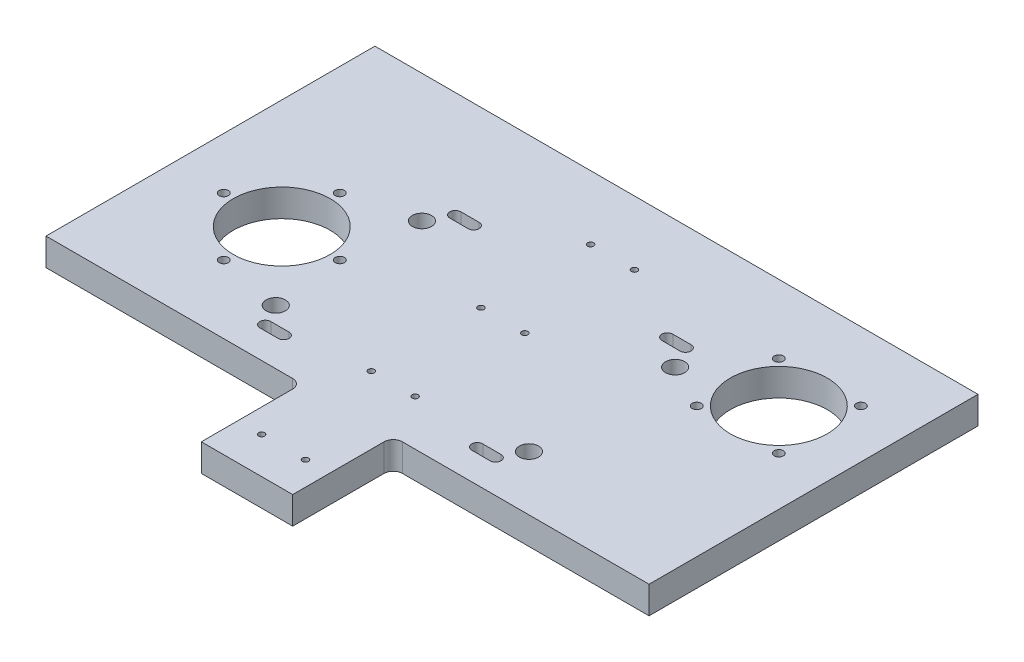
ISO-10303-21;
HEADER;
FILE_DESCRIPTION(('STEP AP214'),'2;1');
FILE_NAME('part.step','',(''),(''),'','','');
FILE_SCHEMA(('AUTOMOTIVE_DESIGN { 1 0 10303 214 1 1 1 1 }'));
ENDSEC;
DATA;
#1=APPLICATION_CONTEXT('core data for automotive mechanical design processes');
#2=APPLICATION_PROTOCOL_DEFINITION('international standard','automotive_design',2000,#1);
#3=PRODUCT_CONTEXT('',#1,'mechanical');
#4=PRODUCT('Part','Part','',(#3));
#5=PRODUCT_RELATED_PRODUCT_CATEGORY('part','',(#4));
#6=PRODUCT_DEFINITION_FORMATION('','',#4);
#7=PRODUCT_DEFINITION_CONTEXT('part definition',#1,'design');
#8=PRODUCT_DEFINITION('design','',#6,#7);
#9=PRODUCT_DEFINITION_SHAPE('','',#8);
#10=(LENGTH_UNIT() NAMED_UNIT(*) SI_UNIT(.MILLI.,.METRE.));
#11=(NAMED_UNIT(*) PLANE_ANGLE_UNIT() SI_UNIT($,.RADIAN.));
#12=(NAMED_UNIT(*) SI_UNIT($,.STERADIAN.) SOLID_ANGLE_UNIT());
#13=UNCERTAINTY_MEASURE_WITH_UNIT(LENGTH_MEASURE(1.E-05),#10,'distance_accuracy_value','');
#14=(GEOMETRIC_REPRESENTATION_CONTEXT(3) GLOBAL_UNCERTAINTY_ASSIGNED_CONTEXT((#13)) GLOBAL_UNIT_ASSIGNED_CONTEXT((#10,
#11,#12)) REPRESENTATION_CONTEXT('',''));
#15=CARTESIAN_POINT('',(0.,0.,0.));
#16=DIRECTION('',(0.,0.,1.));
#17=DIRECTION('',(1.,0.,0.));
#18=AXIS2_PLACEMENT_3D('',#15,#16,#17);
#19=CARTESIAN_POINT('',(-165.,-15.,75.));
#20=DIRECTION('',(0.,0.,1.));
#21=DIRECTION('',(1.,0.,0.));
#22=AXIS2_PLACEMENT_3D('',#19,#20,#21);
#23=PLANE('',#22);
#24=DIRECTION('',(1.,0.,0.));
#25=VECTOR('',#24,1.);
#26=CARTESIAN_POINT('',(-165.,-15.,75.));
#27=LINE('',#26,#25);
#28=CARTESIAN_POINT('',(-165.,-15.,75.));
#29=VERTEX_POINT('',#28);
#30=CARTESIAN_POINT('',(-30.,-15.,75.));
#31=VERTEX_POINT('',#30);
#32=EDGE_CURVE('E464',#29,#31,#27,.T.);
#33=ORIENTED_EDGE('',*,*,#32,.T.);
#34=DIRECTION('',(0.,-1.,0.));
#35=VECTOR('',#34,1.);
#36=CARTESIAN_POINT('',(-30.,-15.,75.));
#37=LINE('',#36,#35);
#38=CARTESIAN_POINT('',(-30.,0.,75.));
#39=VERTEX_POINT('',#38);
#40=EDGE_CURVE('E53',#31,#39,#37,.F.);
#41=ORIENTED_EDGE('',*,*,#40,.T.);
#42=DIRECTION('',(1.,0.,0.));
#43=VECTOR('',#42,1.);
#44=CARTESIAN_POINT('',(-165.,0.,75.));
#45=LINE('',#44,#43);
#46=CARTESIAN_POINT('',(-165.,0.,75.));
#47=VERTEX_POINT('',#46);
#48=EDGE_CURVE('E452',#47,#39,#45,.T.);
#49=ORIENTED_EDGE('',*,*,#48,.F.);
#50=DIRECTION('',(0.,1.,0.));
#51=VECTOR('',#50,1.);
#52=CARTESIAN_POINT('',(-165.,-15.,75.));
#53=LINE('',#52,#51);
#54=EDGE_CURVE('E467',#29,#47,#53,.T.);
#55=ORIENTED_EDGE('',*,*,#54,.F.);
#56=EDGE_LOOP('',(#33,#41,#49,#55));
#57=FACE_BOUND('',#56,.T.);
#58=ADVANCED_FACE('F32',(#57),#23,.T.);
#59=CARTESIAN_POINT('',(165.,-15.,-75.));
#60=DIRECTION('',(1.,0.,0.));
#61=DIRECTION('',(0.,0.,-1.));
#62=AXIS2_PLACEMENT_3D('',#59,#60,#61);
#63=PLANE('',#62);
#64=DIRECTION('',(0.,0.,-1.));
#65=VECTOR('',#64,1.);
#66=CARTESIAN_POINT('',(165.,0.,-75.));
#67=LINE('',#66,#65);
#68=CARTESIAN_POINT('',(165.,0.,75.));
#69=VERTEX_POINT('',#68);
#70=CARTESIAN_POINT('',(165.,0.,-105.));
#71=VERTEX_POINT('',#70);
#72=EDGE_CURVE('E446',#69,#71,#67,.T.);
#73=ORIENTED_EDGE('',*,*,#72,.F.);
#74=DIRECTION('',(0.,1.,0.));
#75=VECTOR('',#74,1.);
#76=CARTESIAN_POINT('',(165.,-15.,75.));
#77=LINE('',#76,#75);
#78=CARTESIAN_POINT('',(165.,-15.,75.));
#79=VERTEX_POINT('',#78);
#80=EDGE_CURVE('E489',#79,#69,#77,.T.);
#81=ORIENTED_EDGE('',*,*,#80,.F.);
#82=DIRECTION('',(0.,0.,-1.));
#83=VECTOR('',#82,1.);
#84=CARTESIAN_POINT('',(165.,-15.,-75.));
#85=LINE('',#84,#83);
#86=CARTESIAN_POINT('',(165.,-15.,-105.));
#87=VERTEX_POINT('',#86);
#88=EDGE_CURVE('E449',#79,#87,#85,.T.);
#89=ORIENTED_EDGE('',*,*,#88,.T.);
#90=DIRECTION('',(0.,-1.,0.));
#91=VECTOR('',#90,1.);
#92=CARTESIAN_POINT('',(165.,-15.,-105.));
#93=LINE('',#92,#91);
#94=EDGE_CURVE('E371',#71,#87,#93,.T.);
#95=ORIENTED_EDGE('',*,*,#94,.F.);
#96=EDGE_LOOP('',(#73,#81,#89,#95));
#97=FACE_BOUND('',#96,.T.);
#98=ADVANCED_FACE('F526',(#97),#63,.T.);
#99=CARTESIAN_POINT('',(29.9999999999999,0.,75.));
#100=VERTEX_POINT('',#99);
#101=EDGE_CURVE('E504',#100,#69,#45,.T.);
#102=ORIENTED_EDGE('',*,*,#101,.F.);
#103=DIRECTION('',(0.,1.,0.));
#104=VECTOR('',#103,1.);
#105=CARTESIAN_POINT('',(29.9999999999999,-15.,75.));
#106=LINE('',#105,#104);
#107=CARTESIAN_POINT('',(29.9999999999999,-15.,75.));
#108=VERTEX_POINT('',#107);
#109=EDGE_CURVE('E488',#100,#108,#106,.F.);
#110=ORIENTED_EDGE('',*,*,#109,.T.);
#111=EDGE_CURVE('E455',#108,#79,#27,.T.);
#112=ORIENTED_EDGE('',*,*,#111,.T.);
#113=ORIENTED_EDGE('',*,*,#80,.T.);
#114=EDGE_LOOP('',(#102,#110,#112,#113));
#115=FACE_BOUND('',#114,.T.);
#116=ADVANCED_FACE('F524',(#115),#23,.T.);
#117=CARTESIAN_POINT('',(-165.,-15.,-75.));
#118=DIRECTION('',(-1.,0.,0.));
#119=DIRECTION('',(0.,0.,1.));
#120=AXIS2_PLACEMENT_3D('',#117,#118,#119);
#121=PLANE('',#120);
#122=DIRECTION('',(0.,0.,1.));
#123=VECTOR('',#122,1.);
#124=CARTESIAN_POINT('',(-165.,0.,-75.));
#125=LINE('',#124,#123);
#126=CARTESIAN_POINT('',(-165.,0.,-105.));
#127=VERTEX_POINT('',#126);
#128=EDGE_CURVE('E502',#127,#47,#125,.T.);
#129=ORIENTED_EDGE('',*,*,#128,.F.);
#130=DIRECTION('',(0.,1.,0.));
#131=VECTOR('',#130,1.);
#132=CARTESIAN_POINT('',(-165.,-15.,-105.));
#133=LINE('',#132,#131);
#134=CARTESIAN_POINT('',(-165.,-15.,-105.));
#135=VERTEX_POINT('',#134);
#136=EDGE_CURVE('E365',#135,#127,#133,.T.);
#137=ORIENTED_EDGE('',*,*,#136,.F.);
#138=DIRECTION('',(0.,0.,1.));
#139=VECTOR('',#138,1.);
#140=CARTESIAN_POINT('',(-165.,-15.,-75.));
#141=LINE('',#140,#139);
#142=EDGE_CURVE('E451',#135,#29,#141,.T.);
#143=ORIENTED_EDGE('',*,*,#142,.T.);
#144=ORIENTED_EDGE('',*,*,#54,.T.);
#145=EDGE_LOOP('',(#129,#137,#143,#144));
#146=FACE_BOUND('',#145,.T.);
#147=ADVANCED_FACE('F533',(#146),#121,.T.);
#148=CARTESIAN_POINT('',(165.,-15.,75.));
#149=DIRECTION('',(0.,1.,0.));
#150=DIRECTION('',(0.,0.,1.));
#151=AXIS2_PLACEMENT_3D('',#148,#149,#150);
#152=PLANE('',#151);
#153=CARTESIAN_POINT('',(12.0000000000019,-15.,-70.));
#154=DIRECTION('',(0.,-1.,0.));
#155=DIRECTION('',(0.,0.,-1.));
#156=AXIS2_PLACEMENT_3D('',#153,#154,#155);
#157=CIRCLE('',#156,1.65);
#158=CARTESIAN_POINT('',(12.0000000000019,-15.,-71.65));
#159=VERTEX_POINT('',#158);
#160=EDGE_CURVE('E1199',#159,#159,#157,.T.);
#161=ORIENTED_EDGE('',*,*,#160,.F.);
#162=EDGE_LOOP('',(#161));
#163=FACE_BOUND('',#162,.T.);
#164=CARTESIAN_POINT('',(-11.9999999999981,-15.,-70.));
#165=DIRECTION('',(0.,-1.,0.));
#166=DIRECTION('',(0.,0.,-1.));
#167=AXIS2_PLACEMENT_3D('',#164,#165,#166);
#168=CIRCLE('',#167,1.65);
#169=CARTESIAN_POINT('',(-11.9999999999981,-15.,-71.65));
#170=VERTEX_POINT('',#169);
#171=EDGE_CURVE('E1195',#170,#170,#168,.T.);
#172=ORIENTED_EDGE('',*,*,#171,.F.);
#173=EDGE_LOOP('',(#172));
#174=FACE_BOUND('',#173,.T.);
#175=CARTESIAN_POINT('',(12.0000000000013,-15.,-9.99999999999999));
#176=DIRECTION('',(0.,-1.,0.));
#177=DIRECTION('',(0.,0.,-1.));
#178=AXIS2_PLACEMENT_3D('',#175,#176,#177);
#179=CIRCLE('',#178,1.65);
#180=CARTESIAN_POINT('',(12.0000000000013,-15.,-11.65));
#181=VERTEX_POINT('',#180);
#182=EDGE_CURVE('E1191',#181,#181,#179,.T.);
#183=ORIENTED_EDGE('',*,*,#182,.F.);
#184=EDGE_LOOP('',(#183));
#185=FACE_BOUND('',#184,.T.);
#186=CARTESIAN_POINT('',(-11.9999999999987,-15.,-9.99999999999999));
#187=DIRECTION('',(0.,-1.,0.));
#188=DIRECTION('',(0.,0.,-1.));
#189=AXIS2_PLACEMENT_3D('',#186,#187,#188);
#190=CIRCLE('',#189,1.65);
#191=CARTESIAN_POINT('',(-11.9999999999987,-15.,-11.65));
#192=VERTEX_POINT('',#191);
#193=EDGE_CURVE('E1187',#192,#192,#190,.T.);
#194=ORIENTED_EDGE('',*,*,#193,.F.);
#195=EDGE_LOOP('',(#194));
#196=FACE_BOUND('',#195,.T.);
#197=CARTESIAN_POINT('',(12.0000000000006,-15.,50.));
#198=DIRECTION('',(0.,-1.,0.));
#199=DIRECTION('',(0.,0.,-1.));
#200=AXIS2_PLACEMENT_3D('',#197,#198,#199);
#201=CIRCLE('',#200,1.65);
#202=CARTESIAN_POINT('',(12.0000000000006,-15.,48.35));
#203=VERTEX_POINT('',#202);
#204=EDGE_CURVE('E1183',#203,#203,#201,.T.);
#205=ORIENTED_EDGE('',*,*,#204,.F.);
#206=EDGE_LOOP('',(#205));
#207=FACE_BOUND('',#206,.T.);
#208=CARTESIAN_POINT('',(-11.9999999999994,-15.,50.));
#209=DIRECTION('',(0.,-1.,0.));
#210=DIRECTION('',(0.,0.,-1.));
#211=AXIS2_PLACEMENT_3D('',#208,#209,#210);
#212=CIRCLE('',#211,1.65);
#213=CARTESIAN_POINT('',(-11.9999999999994,-15.,48.35));
#214=VERTEX_POINT('',#213);
#215=EDGE_CURVE('E1179',#214,#214,#212,.T.);
#216=ORIENTED_EDGE('',*,*,#215,.F.);
#217=EDGE_LOOP('',(#216));
#218=FACE_BOUND('',#217,.T.);
#219=CARTESIAN_POINT('',(12.,-15.,110.));
#220=DIRECTION('',(0.,-1.,0.));
#221=DIRECTION('',(0.,0.,-1.));
#222=AXIS2_PLACEMENT_3D('',#219,#220,#221);
#223=CIRCLE('',#222,1.65);
#224=CARTESIAN_POINT('',(12.,-15.,108.35));
#225=VERTEX_POINT('',#224);
#226=EDGE_CURVE('E1176',#225,#225,#223,.T.);
#227=ORIENTED_EDGE('',*,*,#226,.F.);
#228=EDGE_LOOP('',(#227));
#229=FACE_BOUND('',#228,.T.);
#230=CARTESIAN_POINT('',(-12.,-15.,110.));
#231=DIRECTION('',(0.,-1.,0.));
#232=DIRECTION('',(0.,0.,-1.));
#233=AXIS2_PLACEMENT_3D('',#230,#231,#232);
#234=CIRCLE('',#233,1.65);
#235=CARTESIAN_POINT('',(-12.,-15.,108.35));
#236=VERTEX_POINT('',#235);
#237=EDGE_CURVE('E1172',#236,#236,#234,.T.);
#238=ORIENTED_EDGE('',*,*,#237,.F.);
#239=EDGE_LOOP('',(#238));
#240=FACE_BOUND('',#239,.T.);
#241=DIRECTION('',(1.,0.,0.));
#242=VECTOR('',#241,1.);
#243=CARTESIAN_POINT('',(52.999999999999,-15.,-50.0000000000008));
#244=LINE('',#243,#242);
#245=CARTESIAN_POINT('',(52.999999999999,-15.,-50.0000000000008));
#246=VERTEX_POINT('',#245);
#247=CARTESIAN_POINT('',(62.999999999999,-15.,-50.0000000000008));
#248=VERTEX_POINT('',#247);
#249=EDGE_CURVE('E231',#246,#248,#244,.T.);
#250=ORIENTED_EDGE('',*,*,#249,.F.);
#251=CARTESIAN_POINT('',(52.999999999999,-15.,-47.0000000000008));
#252=DIRECTION('',(0.,1.,0.));
#253=DIRECTION('',(0.,0.,1.));
#254=AXIS2_PLACEMENT_3D('',#251,#252,#253);
#255=CIRCLE('',#254,2.99999999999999);
#256=CARTESIAN_POINT('',(52.999999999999,-15.,-44.0000000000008));
#257=VERTEX_POINT('',#256);
#258=EDGE_CURVE('E209',#257,#246,#255,.F.);
#259=ORIENTED_EDGE('',*,*,#258,.F.);
#260=DIRECTION('',(-1.,0.,0.));
#261=VECTOR('',#260,1.);
#262=CARTESIAN_POINT('',(52.999999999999,-15.,-44.0000000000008));
#263=LINE('',#262,#261);
#264=CARTESIAN_POINT('',(62.999999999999,-15.,-44.0000000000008));
#265=VERTEX_POINT('',#264);
#266=EDGE_CURVE('E221',#265,#257,#263,.T.);
#267=ORIENTED_EDGE('',*,*,#266,.F.);
#268=CARTESIAN_POINT('',(62.999999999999,-15.,-47.0000000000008));
#269=DIRECTION('',(0.,1.,0.));
#270=DIRECTION('',(0.,0.,1.));
#271=AXIS2_PLACEMENT_3D('',#268,#269,#270);
#272=CIRCLE('',#271,3.);
#273=EDGE_CURVE('E235',#248,#265,#272,.F.);
#274=ORIENTED_EDGE('',*,*,#273,.F.);
#275=EDGE_LOOP('',(#250,#259,#267,#274));
#276=FACE_BOUND('',#275,.T.);
#277=DIRECTION('',(1.,0.,0.));
#278=VECTOR('',#277,1.);
#279=CARTESIAN_POINT('',(-63.000000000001,-15.,-50.));
#280=LINE('',#279,#278);
#281=CARTESIAN_POINT('',(-63.000000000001,-15.,-50.));
#282=VERTEX_POINT('',#281);
#283=CARTESIAN_POINT('',(-53.000000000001,-15.,-50.));
#284=VERTEX_POINT('',#283);
#285=EDGE_CURVE('E250',#282,#284,#280,.T.);
#286=ORIENTED_EDGE('',*,*,#285,.F.);
#287=CARTESIAN_POINT('',(-63.000000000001,-15.,-47.));
#288=DIRECTION('',(0.,1.,0.));
#289=DIRECTION('',(0.,0.,1.));
#290=AXIS2_PLACEMENT_3D('',#287,#288,#289);
#291=CIRCLE('',#290,2.99999999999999);
#292=CARTESIAN_POINT('',(-63.000000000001,-15.,-44.));
#293=VERTEX_POINT('',#292);
#294=EDGE_CURVE('E253',#293,#282,#291,.F.);
#295=ORIENTED_EDGE('',*,*,#294,.F.);
#296=DIRECTION('',(-1.,0.,0.));
#297=VECTOR('',#296,1.);
#298=CARTESIAN_POINT('',(-63.000000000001,-15.,-44.));
#299=LINE('',#298,#297);
#300=CARTESIAN_POINT('',(-53.000000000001,-15.,-44.));
#301=VERTEX_POINT('',#300);
#302=EDGE_CURVE('E270',#301,#293,#299,.T.);
#303=ORIENTED_EDGE('',*,*,#302,.F.);
#304=CARTESIAN_POINT('',(-53.000000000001,-15.,-47.));
#305=DIRECTION('',(0.,1.,0.));
#306=DIRECTION('',(0.,0.,1.));
#307=AXIS2_PLACEMENT_3D('',#304,#305,#306);
#308=CIRCLE('',#307,3.);
#309=EDGE_CURVE('E225',#284,#301,#308,.F.);
#310=ORIENTED_EDGE('',*,*,#309,.F.);
#311=EDGE_LOOP('',(#286,#295,#303,#310));
#312=FACE_BOUND('',#311,.T.);
#313=DIRECTION('',(1.,0.,0.));
#314=VECTOR('',#313,1.);
#315=CARTESIAN_POINT('',(53.0000000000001,-15.,53.9999999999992));
#316=LINE('',#315,#314);
#317=CARTESIAN_POINT('',(53.0000000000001,-15.,53.9999999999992));
#318=VERTEX_POINT('',#317);
#319=CARTESIAN_POINT('',(63.0000000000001,-15.,53.9999999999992));
#320=VERTEX_POINT('',#319);
#321=EDGE_CURVE('E281',#318,#320,#316,.T.);
#322=ORIENTED_EDGE('',*,*,#321,.F.);
#323=CARTESIAN_POINT('',(53.0000000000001,-15.,56.9999999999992));
#324=DIRECTION('',(0.,1.,0.));
#325=DIRECTION('',(0.,0.,1.));
#326=AXIS2_PLACEMENT_3D('',#323,#324,#325);
#327=CIRCLE('',#326,3.);
#328=CARTESIAN_POINT('',(53.0000000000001,-15.,59.9999999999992));
#329=VERTEX_POINT('',#328);
#330=EDGE_CURVE('E284',#329,#318,#327,.F.);
#331=ORIENTED_EDGE('',*,*,#330,.F.);
#332=DIRECTION('',(-1.,0.,0.));
#333=VECTOR('',#332,1.);
#334=CARTESIAN_POINT('',(53.0000000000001,-15.,59.9999999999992));
#335=LINE('',#334,#333);
#336=CARTESIAN_POINT('',(63.0000000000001,-15.,59.9999999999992));
#337=VERTEX_POINT('',#336);
#338=EDGE_CURVE('E301',#337,#329,#335,.T.);
#339=ORIENTED_EDGE('',*,*,#338,.F.);
#340=CARTESIAN_POINT('',(63.0000000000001,-15.,56.9999999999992));
#341=DIRECTION('',(0.,1.,0.));
#342=DIRECTION('',(0.,0.,1.));
#343=AXIS2_PLACEMENT_3D('',#340,#341,#342);
#344=CIRCLE('',#343,3.);
#345=EDGE_CURVE('E279',#320,#337,#344,.F.);
#346=ORIENTED_EDGE('',*,*,#345,.F.);
#347=EDGE_LOOP('',(#322,#331,#339,#346));
#348=FACE_BOUND('',#347,.T.);
#349=DIRECTION('',(1.,0.,0.));
#350=VECTOR('',#349,1.);
#351=CARTESIAN_POINT('',(-62.9999999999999,-15.,54.));
#352=LINE('',#351,#350);
#353=CARTESIAN_POINT('',(-62.9999999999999,-15.,54.));
#354=VERTEX_POINT('',#353);
#355=CARTESIAN_POINT('',(-52.9999999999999,-15.,54.));
#356=VERTEX_POINT('',#355);
#357=EDGE_CURVE('E312',#354,#356,#352,.T.);
#358=ORIENTED_EDGE('',*,*,#357,.F.);
#359=CARTESIAN_POINT('',(-62.9999999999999,-15.,57.));
#360=DIRECTION('',(0.,1.,0.));
#361=DIRECTION('',(0.,0.,1.));
#362=AXIS2_PLACEMENT_3D('',#359,#360,#361);
#363=CIRCLE('',#362,2.99999999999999);
#364=CARTESIAN_POINT('',(-62.9999999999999,-15.,60.));
#365=VERTEX_POINT('',#364);
#366=EDGE_CURVE('E315',#365,#354,#363,.F.);
#367=ORIENTED_EDGE('',*,*,#366,.F.);
#368=DIRECTION('',(-1.,0.,0.));
#369=VECTOR('',#368,1.);
#370=CARTESIAN_POINT('',(-62.9999999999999,-15.,60.));
#371=LINE('',#370,#369);
#372=CARTESIAN_POINT('',(-52.9999999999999,-15.,60.));
#373=VERTEX_POINT('',#372);
#374=EDGE_CURVE('E332',#373,#365,#371,.T.);
#375=ORIENTED_EDGE('',*,*,#374,.F.);
#376=CARTESIAN_POINT('',(-52.9999999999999,-15.,57.));
#377=DIRECTION('',(0.,1.,0.));
#378=DIRECTION('',(0.,0.,1.));
#379=AXIS2_PLACEMENT_3D('',#376,#377,#378);
#380=CIRCLE('',#379,3.);
#381=EDGE_CURVE('E310',#356,#373,#380,.F.);
#382=ORIENTED_EDGE('',*,*,#381,.F.);
#383=EDGE_LOOP('',(#358,#367,#375,#382));
#384=FACE_BOUND('',#383,.T.);
#385=CARTESIAN_POINT('',(69.2800000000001,-15.,45.));
#386=DIRECTION('',(0.,1.,0.));
#387=DIRECTION('',(0.,0.,1.));
#388=AXIS2_PLACEMENT_3D('',#385,#386,#387);
#389=CIRCLE('',#388,5.25);
#390=CARTESIAN_POINT('',(69.2800000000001,-15.,50.25));
#391=VERTEX_POINT('',#390);
#392=EDGE_CURVE('E344',#391,#391,#389,.F.);
#393=ORIENTED_EDGE('',*,*,#392,.F.);
#394=EDGE_LOOP('',(#393));
#395=FACE_BOUND('',#394,.T.);
#396=CARTESIAN_POINT('',(69.2800000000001,-15.,-35.));
#397=DIRECTION('',(0.,1.,0.));
#398=DIRECTION('',(0.,0.,1.));
#399=AXIS2_PLACEMENT_3D('',#396,#397,#398);
#400=CIRCLE('',#399,5.24999999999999);
#401=CARTESIAN_POINT('',(69.2800000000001,-15.,-29.75));
#402=VERTEX_POINT('',#401);
#403=EDGE_CURVE('E350',#402,#402,#400,.F.);
#404=ORIENTED_EDGE('',*,*,#403,.F.);
#405=EDGE_LOOP('',(#404));
#406=FACE_BOUND('',#405,.T.);
#407=CARTESIAN_POINT('',(-69.28,-15.,45.));
#408=DIRECTION('',(0.,1.,0.));
#409=DIRECTION('',(0.,0.,1.));
#410=AXIS2_PLACEMENT_3D('',#407,#408,#409);
#411=CIRCLE('',#410,5.25);
#412=CARTESIAN_POINT('',(-69.28,-15.,50.25));
#413=VERTEX_POINT('',#412);
#414=EDGE_CURVE('E356',#413,#413,#411,.F.);
#415=ORIENTED_EDGE('',*,*,#414,.F.);
#416=EDGE_LOOP('',(#415));
#417=FACE_BOUND('',#416,.T.);
#418=CARTESIAN_POINT('',(-69.2799999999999,-15.,-35.));
#419=DIRECTION('',(0.,1.,0.));
#420=DIRECTION('',(0.,0.,1.));
#421=AXIS2_PLACEMENT_3D('',#418,#419,#420);
#422=CIRCLE('',#421,5.25);
#423=CARTESIAN_POINT('',(-69.2799999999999,-15.,-29.75));
#424=VERTEX_POINT('',#423);
#425=EDGE_CURVE('E362',#424,#424,#422,.F.);
#426=ORIENTED_EDGE('',*,*,#425,.F.);
#427=EDGE_LOOP('',(#426));
#428=FACE_BOUND('',#427,.T.);
#429=CARTESIAN_POINT('',(-136.734958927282,-15.,6.01502683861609));
#430=DIRECTION('',(0.,1.,0.));
#431=DIRECTION('',(0.,0.,1.));
#432=AXIS2_PLACEMENT_3D('',#429,#430,#431);
#433=CIRCLE('',#432,2.5);
#434=CARTESIAN_POINT('',(-136.734958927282,-15.,8.51502683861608));
#435=VERTEX_POINT('',#434);
#436=EDGE_CURVE('E387',#435,#435,#433,.T.);
#437=ORIENTED_EDGE('',*,*,#436,.T.);
#438=EDGE_LOOP('',(#437));
#439=FACE_BOUND('',#438,.T.);
#440=CARTESIAN_POINT('',(-104.969949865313,-15.,37.7499857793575));
#441=DIRECTION('',(0.,1.,0.));
#442=DIRECTION('',(0.,0.,1.));
#443=AXIS2_PLACEMENT_3D('',#440,#441,#442);
#444=CIRCLE('',#443,2.5);
#445=CARTESIAN_POINT('',(-104.969949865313,-15.,40.2499857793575));
#446=VERTEX_POINT('',#445);
#447=EDGE_CURVE('E395',#446,#446,#444,.T.);
#448=ORIENTED_EDGE('',*,*,#447,.T.);
#449=EDGE_LOOP('',(#448));
#450=FACE_BOUND('',#449,.T.);
#451=CARTESIAN_POINT('',(-73.2349909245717,-15.,5.98497671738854));
#452=DIRECTION('',(0.,1.,0.));
#453=DIRECTION('',(0.,0.,1.));
#454=AXIS2_PLACEMENT_3D('',#451,#452,#453);
#455=CIRCLE('',#454,2.5);
#456=CARTESIAN_POINT('',(-73.2349909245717,-15.,8.48497671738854));
#457=VERTEX_POINT('',#456);
#458=EDGE_CURVE('E401',#457,#457,#455,.T.);
#459=ORIENTED_EDGE('',*,*,#458,.T.);
#460=EDGE_LOOP('',(#459));
#461=FACE_BOUND('',#460,.T.);
#462=CARTESIAN_POINT('',(138.450640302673,-15.,-67.4506403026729));
#463=DIRECTION('',(0.,1.,0.));
#464=DIRECTION('',(0.,0.,1.));
#465=AXIS2_PLACEMENT_3D('',#462,#463,#464);
#466=CIRCLE('',#465,2.5);
#467=CARTESIAN_POINT('',(138.450640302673,-15.,-64.9506403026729));
#468=VERTEX_POINT('',#467);
#469=EDGE_CURVE('E407',#468,#468,#466,.T.);
#470=ORIENTED_EDGE('',*,*,#469,.T.);
#471=EDGE_LOOP('',(#470));
#472=FACE_BOUND('',#471,.T.);
#473=CARTESIAN_POINT('',(93.5493596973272,-15.,-67.4506403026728));
#474=DIRECTION('',(0.,1.,0.));
#475=DIRECTION('',(0.,0.,1.));
#476=AXIS2_PLACEMENT_3D('',#473,#474,#475);
#477=CIRCLE('',#476,2.5);
#478=CARTESIAN_POINT('',(93.5493596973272,-15.,-64.9506403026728));
#479=VERTEX_POINT('',#478);
#480=EDGE_CURVE('E413',#479,#479,#477,.T.);
#481=ORIENTED_EDGE('',*,*,#480,.T.);
#482=EDGE_LOOP('',(#481));
#483=FACE_BOUND('',#482,.T.);
#484=CARTESIAN_POINT('',(93.5493596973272,-15.,-22.5493596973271));
#485=DIRECTION('',(0.,1.,0.));
#486=DIRECTION('',(0.,0.,1.));
#487=AXIS2_PLACEMENT_3D('',#484,#485,#486);
#488=CIRCLE('',#487,2.5);
#489=CARTESIAN_POINT('',(93.5493596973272,-15.,-20.0493596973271));
#490=VERTEX_POINT('',#489);
#491=EDGE_CURVE('E419',#490,#490,#488,.T.);
#492=ORIENTED_EDGE('',*,*,#491,.T.);
#493=EDGE_LOOP('',(#492));
#494=FACE_BOUND('',#493,.T.);
#495=CARTESIAN_POINT('',(138.450640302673,-15.,-22.5493596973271));
#496=DIRECTION('',(0.,1.,0.));
#497=DIRECTION('',(0.,0.,1.));
#498=AXIS2_PLACEMENT_3D('',#495,#496,#497);
#499=CIRCLE('',#498,2.5);
#500=CARTESIAN_POINT('',(138.450640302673,-15.,-20.0493596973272));
#501=VERTEX_POINT('',#500);
#502=EDGE_CURVE('E425',#501,#501,#499,.T.);
#503=ORIENTED_EDGE('',*,*,#502,.T.);
#504=EDGE_LOOP('',(#503));
#505=FACE_BOUND('',#504,.T.);
#506=CARTESIAN_POINT('',(-104.999999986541,-15.,-25.7499822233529));
#507=DIRECTION('',(0.,1.,0.));
#508=DIRECTION('',(0.,0.,1.));
#509=AXIS2_PLACEMENT_3D('',#506,#507,#508);
#510=CIRCLE('',#509,2.50000000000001);
#511=CARTESIAN_POINT('',(-104.999999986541,-15.,-23.2499822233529));
#512=VERTEX_POINT('',#511);
#513=EDGE_CURVE('E431',#512,#512,#510,.T.);
#514=ORIENTED_EDGE('',*,*,#513,.T.);
#515=EDGE_LOOP('',(#514));
#516=FACE_BOUND('',#515,.T.);
#517=CARTESIAN_POINT('',(-105.,-15.,6.));
#518=DIRECTION('',(0.,1.,0.));
#519=DIRECTION('',(0.,0.,1.));
#520=AXIS2_PLACEMENT_3D('',#517,#518,#519);
#521=CIRCLE('',#520,26.5);
#522=CARTESIAN_POINT('',(-105.,-15.,32.5));
#523=VERTEX_POINT('',#522);
#524=EDGE_CURVE('E437',#523,#523,#521,.T.);
#525=ORIENTED_EDGE('',*,*,#524,.T.);
#526=EDGE_LOOP('',(#525));
#527=FACE_BOUND('',#526,.T.);
#528=CARTESIAN_POINT('',(116.,-15.,-45.));
#529=DIRECTION('',(0.,1.,0.));
#530=DIRECTION('',(0.,0.,1.));
#531=AXIS2_PLACEMENT_3D('',#528,#529,#530);
#532=CIRCLE('',#531,26.5);
#533=CARTESIAN_POINT('',(116.,-15.,-18.5));
#534=VERTEX_POINT('',#533);
#535=EDGE_CURVE('E443',#534,#534,#532,.T.);
#536=ORIENTED_EDGE('',*,*,#535,.T.);
#537=EDGE_LOOP('',(#536));
#538=FACE_BOUND('',#537,.T.);
#539=ORIENTED_EDGE('',*,*,#88,.F.);
#540=ORIENTED_EDGE('',*,*,#111,.F.);
#541=CARTESIAN_POINT('',(29.9999999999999,-15.,80.));
#542=DIRECTION('',(0.,1.,0.));
#543=DIRECTION('',(0.,0.,1.));
#544=AXIS2_PLACEMENT_3D('',#541,#542,#543);
#545=CIRCLE('',#544,5.);
#546=CARTESIAN_POINT('',(24.9999999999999,-15.,80.));
#547=VERTEX_POINT('',#546);
#548=EDGE_CURVE('E511',#108,#547,#545,.T.);
#549=ORIENTED_EDGE('',*,*,#548,.T.);
#550=DIRECTION('',(0.,0.,-1.));
#551=VECTOR('',#550,1.);
#552=CARTESIAN_POINT('',(24.9999999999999,-15.,130.));
#553=LINE('',#552,#551);
#554=CARTESIAN_POINT('',(24.9999999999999,-15.,130.));
#555=VERTEX_POINT('',#554);
#556=EDGE_CURVE('E473',#555,#547,#553,.T.);
#557=ORIENTED_EDGE('',*,*,#556,.F.);
#558=DIRECTION('',(1.,0.,0.));
#559=VECTOR('',#558,1.);
#560=CARTESIAN_POINT('',(-25.,-15.,130.));
#561=LINE('',#560,#559);
#562=CARTESIAN_POINT('',(-25.,-15.,130.));
#563=VERTEX_POINT('',#562);
#564=EDGE_CURVE('E380',#563,#555,#561,.T.);
#565=ORIENTED_EDGE('',*,*,#564,.F.);
#566=DIRECTION('',(0.,0.,-1.));
#567=VECTOR('',#566,1.);
#568=CARTESIAN_POINT('',(-25.,-15.,130.));
#569=LINE('',#568,#567);
#570=CARTESIAN_POINT('',(-25.,-15.,80.));
#571=VERTEX_POINT('',#570);
#572=EDGE_CURVE('E394',#563,#571,#569,.T.);
#573=ORIENTED_EDGE('',*,*,#572,.T.);
#574=CARTESIAN_POINT('',(-30.,-15.,80.));
#575=DIRECTION('',(0.,1.,0.));
#576=DIRECTION('',(0.,0.,1.));
#577=AXIS2_PLACEMENT_3D('',#574,#575,#576);
#578=CIRCLE('',#577,5.);
#579=EDGE_CURVE('E40',#571,#31,#578,.T.);
#580=ORIENTED_EDGE('',*,*,#579,.T.);
#581=ORIENTED_EDGE('',*,*,#32,.F.);
#582=ORIENTED_EDGE('',*,*,#142,.F.);
#583=DIRECTION('',(-1.,0.,0.));
#584=VECTOR('',#583,1.);
#585=CARTESIAN_POINT('',(-165.,-15.,-105.));
#586=LINE('',#585,#584);
#587=EDGE_CURVE('E374',#87,#135,#586,.T.);
#588=ORIENTED_EDGE('',*,*,#587,.F.);
#589=EDGE_LOOP('',(#539,#540,#549,#557,#565,#573,#580,#581,#582,#588));
#590=FACE_BOUND('',#589,.T.);
#591=ADVANCED_FACE('F228',(#163,#174,#185,#196,#207,#218,#229,#240,#276,#312,#348,#384,#395,
#406,#417,#428,#439,#450,#461,#472,#483,#494,#505,#516,#527,#538,#590),#152,.F.);
#592=CARTESIAN_POINT('',(165.,0.,75.));
#593=DIRECTION('',(0.,1.,0.));
#594=DIRECTION('',(0.,0.,1.));
#595=AXIS2_PLACEMENT_3D('',#592,#593,#594);
#596=PLANE('',#595);
#597=CARTESIAN_POINT('',(12.0000000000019,0.,-70.));
#598=DIRECTION('',(0.,1.,0.));
#599=DIRECTION('',(0.,0.,1.));
#600=AXIS2_PLACEMENT_3D('',#597,#598,#599);
#601=CIRCLE('',#600,1.65);
#602=CARTESIAN_POINT('',(12.0000000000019,0.,-68.35));
#603=VERTEX_POINT('',#602);
#604=EDGE_CURVE('E1093',#603,#603,#601,.F.);
#605=ORIENTED_EDGE('',*,*,#604,.T.);
#606=EDGE_LOOP('',(#605));
#607=FACE_BOUND('',#606,.T.);
#608=CARTESIAN_POINT('',(-11.9999999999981,0.,-70.));
#609=DIRECTION('',(0.,1.,0.));
#610=DIRECTION('',(0.,0.,1.));
#611=AXIS2_PLACEMENT_3D('',#608,#609,#610);
#612=CIRCLE('',#611,1.65);
#613=CARTESIAN_POINT('',(-11.9999999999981,0.,-68.35));
#614=VERTEX_POINT('',#613);
#615=EDGE_CURVE('E1097',#614,#614,#612,.F.);
#616=ORIENTED_EDGE('',*,*,#615,.T.);
#617=EDGE_LOOP('',(#616));
#618=FACE_BOUND('',#617,.T.);
#619=CARTESIAN_POINT('',(12.0000000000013,0.,-9.99999999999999));
#620=DIRECTION('',(0.,1.,0.));
#621=DIRECTION('',(0.,0.,1.));
#622=AXIS2_PLACEMENT_3D('',#619,#620,#621);
#623=CIRCLE('',#622,1.65);
#624=CARTESIAN_POINT('',(12.0000000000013,0.,-8.34999999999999));
#625=VERTEX_POINT('',#624);
#626=EDGE_CURVE('E1101',#625,#625,#623,.F.);
#627=ORIENTED_EDGE('',*,*,#626,.T.);
#628=EDGE_LOOP('',(#627));
#629=FACE_BOUND('',#628,.T.);
#630=CARTESIAN_POINT('',(-11.9999999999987,0.,-9.99999999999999));
#631=DIRECTION('',(0.,1.,0.));
#632=DIRECTION('',(0.,0.,1.));
#633=AXIS2_PLACEMENT_3D('',#630,#631,#632);
#634=CIRCLE('',#633,1.65);
#635=CARTESIAN_POINT('',(-11.9999999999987,0.,-8.34999999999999));
#636=VERTEX_POINT('',#635);
#637=EDGE_CURVE('E1105',#636,#636,#634,.F.);
#638=ORIENTED_EDGE('',*,*,#637,.T.);
#639=EDGE_LOOP('',(#638));
#640=FACE_BOUND('',#639,.T.);
#641=CARTESIAN_POINT('',(12.0000000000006,0.,50.));
#642=DIRECTION('',(0.,1.,0.));
#643=DIRECTION('',(0.,0.,1.));
#644=AXIS2_PLACEMENT_3D('',#641,#642,#643);
#645=CIRCLE('',#644,1.65);
#646=CARTESIAN_POINT('',(12.0000000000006,0.,51.65));
#647=VERTEX_POINT('',#646);
#648=EDGE_CURVE('E1109',#647,#647,#645,.F.);
#649=ORIENTED_EDGE('',*,*,#648,.T.);
#650=EDGE_LOOP('',(#649));
#651=FACE_BOUND('',#650,.T.);
#652=CARTESIAN_POINT('',(-11.9999999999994,0.,50.));
#653=DIRECTION('',(0.,1.,0.));
#654=DIRECTION('',(0.,0.,1.));
#655=AXIS2_PLACEMENT_3D('',#652,#653,#654);
#656=CIRCLE('',#655,1.65);
#657=CARTESIAN_POINT('',(-11.9999999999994,0.,51.65));
#658=VERTEX_POINT('',#657);
#659=EDGE_CURVE('E1113',#658,#658,#656,.F.);
#660=ORIENTED_EDGE('',*,*,#659,.T.);
#661=EDGE_LOOP('',(#660));
#662=FACE_BOUND('',#661,.T.);
#663=CARTESIAN_POINT('',(12.,0.,110.));
#664=DIRECTION('',(0.,1.,0.));
#665=DIRECTION('',(0.,0.,1.));
#666=AXIS2_PLACEMENT_3D('',#663,#664,#665);
#667=CIRCLE('',#666,1.65);
#668=CARTESIAN_POINT('',(12.,0.,111.65));
#669=VERTEX_POINT('',#668);
#670=EDGE_CURVE('E1117',#669,#669,#667,.F.);
#671=ORIENTED_EDGE('',*,*,#670,.T.);
#672=EDGE_LOOP('',(#671));
#673=FACE_BOUND('',#672,.T.);
#674=CARTESIAN_POINT('',(-12.,0.,110.));
#675=DIRECTION('',(0.,1.,0.));
#676=DIRECTION('',(0.,0.,1.));
#677=AXIS2_PLACEMENT_3D('',#674,#675,#676);
#678=CIRCLE('',#677,1.65);
#679=CARTESIAN_POINT('',(-12.,0.,111.65));
#680=VERTEX_POINT('',#679);
#681=EDGE_CURVE('E1121',#680,#680,#678,.F.);
#682=ORIENTED_EDGE('',*,*,#681,.T.);
#683=EDGE_LOOP('',(#682));
#684=FACE_BOUND('',#683,.T.);
#685=CARTESIAN_POINT('',(52.999999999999,0.,-47.0000000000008));
#686=DIRECTION('',(0.,1.,0.));
#687=DIRECTION('',(0.,0.,1.));
#688=AXIS2_PLACEMENT_3D('',#685,#686,#687);
#689=CIRCLE('',#688,2.99999999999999);
#690=CARTESIAN_POINT('',(52.999999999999,0.,-50.0000000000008));
#691=VERTEX_POINT('',#690);
#692=CARTESIAN_POINT('',(52.999999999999,0.,-44.0000000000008));
#693=VERTEX_POINT('',#692);
#694=EDGE_CURVE('E212',#691,#693,#689,.T.);
#695=ORIENTED_EDGE('',*,*,#694,.F.);
#696=DIRECTION('',(-1.,0.,0.));
#697=VECTOR('',#696,1.);
#698=CARTESIAN_POINT('',(52.999999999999,0.,-50.0000000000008));
#699=LINE('',#698,#697);
#700=CARTESIAN_POINT('',(62.999999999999,0.,-50.0000000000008));
#701=VERTEX_POINT('',#700);
#702=EDGE_CURVE('E217',#701,#691,#699,.T.);
#703=ORIENTED_EDGE('',*,*,#702,.F.);
#704=CARTESIAN_POINT('',(62.999999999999,0.,-47.0000000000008));
#705=DIRECTION('',(0.,1.,0.));
#706=DIRECTION('',(0.,0.,1.));
#707=AXIS2_PLACEMENT_3D('',#704,#705,#706);
#708=CIRCLE('',#707,3.);
#709=CARTESIAN_POINT('',(62.999999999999,0.,-44.0000000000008));
#710=VERTEX_POINT('',#709);
#711=EDGE_CURVE('E240',#710,#701,#708,.T.);
#712=ORIENTED_EDGE('',*,*,#711,.F.);
#713=DIRECTION('',(1.,0.,0.));
#714=VECTOR('',#713,1.);
#715=CARTESIAN_POINT('',(52.999999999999,0.,-44.0000000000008));
#716=LINE('',#715,#714);
#717=EDGE_CURVE('E233',#693,#710,#716,.T.);
#718=ORIENTED_EDGE('',*,*,#717,.F.);
#719=EDGE_LOOP('',(#695,#703,#712,#718));
#720=FACE_BOUND('',#719,.T.);
#721=CARTESIAN_POINT('',(-63.000000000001,0.,-47.));
#722=DIRECTION('',(0.,1.,0.));
#723=DIRECTION('',(0.,0.,1.));
#724=AXIS2_PLACEMENT_3D('',#721,#722,#723);
#725=CIRCLE('',#724,2.99999999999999);
#726=CARTESIAN_POINT('',(-63.000000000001,0.,-50.));
#727=VERTEX_POINT('',#726);
#728=CARTESIAN_POINT('',(-63.000000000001,0.,-44.));
#729=VERTEX_POINT('',#728);
#730=EDGE_CURVE('E256',#727,#729,#725,.T.);
#731=ORIENTED_EDGE('',*,*,#730,.F.);
#732=DIRECTION('',(-1.,0.,0.));
#733=VECTOR('',#732,1.);
#734=CARTESIAN_POINT('',(-63.000000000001,0.,-50.));
#735=LINE('',#734,#733);
#736=CARTESIAN_POINT('',(-53.000000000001,0.,-50.));
#737=VERTEX_POINT('',#736);
#738=EDGE_CURVE('E264',#737,#727,#735,.T.);
#739=ORIENTED_EDGE('',*,*,#738,.F.);
#740=CARTESIAN_POINT('',(-53.000000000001,0.,-47.));
#741=DIRECTION('',(0.,1.,0.));
#742=DIRECTION('',(0.,0.,1.));
#743=AXIS2_PLACEMENT_3D('',#740,#741,#742);
#744=CIRCLE('',#743,3.);
#745=CARTESIAN_POINT('',(-53.000000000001,0.,-44.));
#746=VERTEX_POINT('',#745);
#747=EDGE_CURVE('E261',#746,#737,#744,.T.);
#748=ORIENTED_EDGE('',*,*,#747,.F.);
#749=DIRECTION('',(1.,0.,0.));
#750=VECTOR('',#749,1.);
#751=CARTESIAN_POINT('',(-63.000000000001,0.,-44.));
#752=LINE('',#751,#750);
#753=EDGE_CURVE('E258',#729,#746,#752,.T.);
#754=ORIENTED_EDGE('',*,*,#753,.F.);
#755=EDGE_LOOP('',(#731,#739,#748,#754));
#756=FACE_BOUND('',#755,.T.);
#757=CARTESIAN_POINT('',(53.0000000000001,0.,56.9999999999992));
#758=DIRECTION('',(0.,1.,0.));
#759=DIRECTION('',(0.,0.,1.));
#760=AXIS2_PLACEMENT_3D('',#757,#758,#759);
#761=CIRCLE('',#760,3.);
#762=CARTESIAN_POINT('',(53.0000000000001,0.,53.9999999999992));
#763=VERTEX_POINT('',#762);
#764=CARTESIAN_POINT('',(53.0000000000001,0.,59.9999999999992));
#765=VERTEX_POINT('',#764);
#766=EDGE_CURVE('E287',#763,#765,#761,.T.);
#767=ORIENTED_EDGE('',*,*,#766,.F.);
#768=DIRECTION('',(-1.,0.,0.));
#769=VECTOR('',#768,1.);
#770=CARTESIAN_POINT('',(53.0000000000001,0.,53.9999999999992));
#771=LINE('',#770,#769);
#772=CARTESIAN_POINT('',(63.0000000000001,0.,53.9999999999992));
#773=VERTEX_POINT('',#772);
#774=EDGE_CURVE('E295',#773,#763,#771,.T.);
#775=ORIENTED_EDGE('',*,*,#774,.F.);
#776=CARTESIAN_POINT('',(63.0000000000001,0.,56.9999999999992));
#777=DIRECTION('',(0.,1.,0.));
#778=DIRECTION('',(0.,0.,1.));
#779=AXIS2_PLACEMENT_3D('',#776,#777,#778);
#780=CIRCLE('',#779,3.);
#781=CARTESIAN_POINT('',(63.0000000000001,0.,59.9999999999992));
#782=VERTEX_POINT('',#781);
#783=EDGE_CURVE('E292',#782,#773,#780,.T.);
#784=ORIENTED_EDGE('',*,*,#783,.F.);
#785=DIRECTION('',(1.,0.,0.));
#786=VECTOR('',#785,1.);
#787=CARTESIAN_POINT('',(53.0000000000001,0.,59.9999999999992));
#788=LINE('',#787,#786);
#789=EDGE_CURVE('E289',#765,#782,#788,.T.);
#790=ORIENTED_EDGE('',*,*,#789,.F.);
#791=EDGE_LOOP('',(#767,#775,#784,#790));
#792=FACE_BOUND('',#791,.T.);
#793=CARTESIAN_POINT('',(-62.9999999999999,0.,57.));
#794=DIRECTION('',(0.,1.,0.));
#795=DIRECTION('',(0.,0.,1.));
#796=AXIS2_PLACEMENT_3D('',#793,#794,#795);
#797=CIRCLE('',#796,2.99999999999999);
#798=CARTESIAN_POINT('',(-62.9999999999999,0.,54.));
#799=VERTEX_POINT('',#798);
#800=CARTESIAN_POINT('',(-62.9999999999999,0.,60.));
#801=VERTEX_POINT('',#800);
#802=EDGE_CURVE('E318',#799,#801,#797,.T.);
#803=ORIENTED_EDGE('',*,*,#802,.F.);
#804=DIRECTION('',(-1.,0.,0.));
#805=VECTOR('',#804,1.);
#806=CARTESIAN_POINT('',(-62.9999999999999,0.,54.));
#807=LINE('',#806,#805);
#808=CARTESIAN_POINT('',(-52.9999999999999,0.,54.));
#809=VERTEX_POINT('',#808);
#810=EDGE_CURVE('E326',#809,#799,#807,.T.);
#811=ORIENTED_EDGE('',*,*,#810,.F.);
#812=CARTESIAN_POINT('',(-52.9999999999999,0.,57.));
#813=DIRECTION('',(0.,1.,0.));
#814=DIRECTION('',(0.,0.,1.));
#815=AXIS2_PLACEMENT_3D('',#812,#813,#814);
#816=CIRCLE('',#815,3.);
#817=CARTESIAN_POINT('',(-52.9999999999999,0.,60.));
#818=VERTEX_POINT('',#817);
#819=EDGE_CURVE('E323',#818,#809,#816,.T.);
#820=ORIENTED_EDGE('',*,*,#819,.F.);
#821=DIRECTION('',(1.,0.,0.));
#822=VECTOR('',#821,1.);
#823=CARTESIAN_POINT('',(-62.9999999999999,0.,60.));
#824=LINE('',#823,#822);
#825=EDGE_CURVE('E320',#801,#818,#824,.T.);
#826=ORIENTED_EDGE('',*,*,#825,.F.);
#827=EDGE_LOOP('',(#803,#811,#820,#826));
#828=FACE_BOUND('',#827,.T.);
#829=CARTESIAN_POINT('',(69.2800000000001,0.,45.));
#830=DIRECTION('',(0.,1.,0.));
#831=DIRECTION('',(0.,0.,1.));
#832=AXIS2_PLACEMENT_3D('',#829,#830,#831);
#833=CIRCLE('',#832,5.25);
#834=CARTESIAN_POINT('',(69.2800000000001,0.,50.25));
#835=VERTEX_POINT('',#834);
#836=EDGE_CURVE('E341',#835,#835,#833,.T.);
#837=ORIENTED_EDGE('',*,*,#836,.F.);
#838=EDGE_LOOP('',(#837));
#839=FACE_BOUND('',#838,.T.);
#840=CARTESIAN_POINT('',(69.2800000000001,0.,-35.));
#841=DIRECTION('',(0.,1.,0.));
#842=DIRECTION('',(0.,0.,1.));
#843=AXIS2_PLACEMENT_3D('',#840,#841,#842);
#844=CIRCLE('',#843,5.24999999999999);
#845=CARTESIAN_POINT('',(69.2800000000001,0.,-29.75));
#846=VERTEX_POINT('',#845);
#847=EDGE_CURVE('E347',#846,#846,#844,.T.);
#848=ORIENTED_EDGE('',*,*,#847,.F.);
#849=EDGE_LOOP('',(#848));
#850=FACE_BOUND('',#849,.T.);
#851=CARTESIAN_POINT('',(-69.28,0.,45.));
#852=DIRECTION('',(0.,1.,0.));
#853=DIRECTION('',(0.,0.,1.));
#854=AXIS2_PLACEMENT_3D('',#851,#852,#853);
#855=CIRCLE('',#854,5.25);
#856=CARTESIAN_POINT('',(-69.28,0.,50.25));
#857=VERTEX_POINT('',#856);
#858=EDGE_CURVE('E353',#857,#857,#855,.T.);
#859=ORIENTED_EDGE('',*,*,#858,.F.);
#860=EDGE_LOOP('',(#859));
#861=FACE_BOUND('',#860,.T.);
#862=CARTESIAN_POINT('',(-69.2799999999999,0.,-35.));
#863=DIRECTION('',(0.,1.,0.));
#864=DIRECTION('',(0.,0.,1.));
#865=AXIS2_PLACEMENT_3D('',#862,#863,#864);
#866=CIRCLE('',#865,5.25);
#867=CARTESIAN_POINT('',(-69.2799999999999,0.,-29.75));
#868=VERTEX_POINT('',#867);
#869=EDGE_CURVE('E359',#868,#868,#866,.T.);
#870=ORIENTED_EDGE('',*,*,#869,.F.);
#871=EDGE_LOOP('',(#870));
#872=FACE_BOUND('',#871,.T.);
#873=CARTESIAN_POINT('',(-136.734958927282,0.,6.01502683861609));
#874=DIRECTION('',(0.,1.,0.));
#875=DIRECTION('',(0.,0.,1.));
#876=AXIS2_PLACEMENT_3D('',#873,#874,#875);
#877=CIRCLE('',#876,2.5);
#878=CARTESIAN_POINT('',(-136.734958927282,0.,8.51502683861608));
#879=VERTEX_POINT('',#878);
#880=EDGE_CURVE('E391',#879,#879,#877,.T.);
#881=ORIENTED_EDGE('',*,*,#880,.F.);
#882=EDGE_LOOP('',(#881));
#883=FACE_BOUND('',#882,.T.);
#884=CARTESIAN_POINT('',(-104.969949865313,0.,37.7499857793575));
#885=DIRECTION('',(0.,1.,0.));
#886=DIRECTION('',(0.,0.,1.));
#887=AXIS2_PLACEMENT_3D('',#884,#885,#886);
#888=CIRCLE('',#887,2.5);
#889=CARTESIAN_POINT('',(-104.969949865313,0.,40.2499857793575));
#890=VERTEX_POINT('',#889);
#891=EDGE_CURVE('E390',#890,#890,#888,.T.);
#892=ORIENTED_EDGE('',*,*,#891,.F.);
#893=EDGE_LOOP('',(#892));
#894=FACE_BOUND('',#893,.T.);
#895=CARTESIAN_POINT('',(-73.2349909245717,0.,5.98497671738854));
#896=DIRECTION('',(0.,1.,0.));
#897=DIRECTION('',(0.,0.,1.));
#898=AXIS2_PLACEMENT_3D('',#895,#896,#897);
#899=CIRCLE('',#898,2.5);
#900=CARTESIAN_POINT('',(-73.2349909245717,0.,8.48497671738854));
#901=VERTEX_POINT('',#900);
#902=EDGE_CURVE('E398',#901,#901,#899,.T.);
#903=ORIENTED_EDGE('',*,*,#902,.F.);
#904=EDGE_LOOP('',(#903));
#905=FACE_BOUND('',#904,.T.);
#906=CARTESIAN_POINT('',(138.450640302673,0.,-67.4506403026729));
#907=DIRECTION('',(0.,1.,0.));
#908=DIRECTION('',(0.,0.,1.));
#909=AXIS2_PLACEMENT_3D('',#906,#907,#908);
#910=CIRCLE('',#909,2.5);
#911=CARTESIAN_POINT('',(138.450640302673,0.,-64.9506403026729));
#912=VERTEX_POINT('',#911);
#913=EDGE_CURVE('E404',#912,#912,#910,.T.);
#914=ORIENTED_EDGE('',*,*,#913,.F.);
#915=EDGE_LOOP('',(#914));
#916=FACE_BOUND('',#915,.T.);
#917=CARTESIAN_POINT('',(93.5493596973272,0.,-67.4506403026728));
#918=DIRECTION('',(0.,1.,0.));
#919=DIRECTION('',(0.,0.,1.));
#920=AXIS2_PLACEMENT_3D('',#917,#918,#919);
#921=CIRCLE('',#920,2.5);
#922=CARTESIAN_POINT('',(93.5493596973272,0.,-64.9506403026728));
#923=VERTEX_POINT('',#922);
#924=EDGE_CURVE('E410',#923,#923,#921,.T.);
#925=ORIENTED_EDGE('',*,*,#924,.F.);
#926=EDGE_LOOP('',(#925));
#927=FACE_BOUND('',#926,.T.);
#928=CARTESIAN_POINT('',(93.5493596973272,0.,-22.5493596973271));
#929=DIRECTION('',(0.,1.,0.));
#930=DIRECTION('',(0.,0.,1.));
#931=AXIS2_PLACEMENT_3D('',#928,#929,#930);
#932=CIRCLE('',#931,2.5);
#933=CARTESIAN_POINT('',(93.5493596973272,0.,-20.0493596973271));
#934=VERTEX_POINT('',#933);
#935=EDGE_CURVE('E416',#934,#934,#932,.T.);
#936=ORIENTED_EDGE('',*,*,#935,.F.);
#937=EDGE_LOOP('',(#936));
#938=FACE_BOUND('',#937,.T.);
#939=CARTESIAN_POINT('',(138.450640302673,0.,-22.5493596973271));
#940=DIRECTION('',(0.,1.,0.));
#941=DIRECTION('',(0.,0.,1.));
#942=AXIS2_PLACEMENT_3D('',#939,#940,#941);
#943=CIRCLE('',#942,2.5);
#944=CARTESIAN_POINT('',(138.450640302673,0.,-20.0493596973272));
#945=VERTEX_POINT('',#944);
#946=EDGE_CURVE('E422',#945,#945,#943,.T.);
#947=ORIENTED_EDGE('',*,*,#946,.F.);
#948=EDGE_LOOP('',(#947));
#949=FACE_BOUND('',#948,.T.);
#950=CARTESIAN_POINT('',(-104.999999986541,0.,-25.7499822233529));
#951=DIRECTION('',(0.,1.,0.));
#952=DIRECTION('',(0.,0.,1.));
#953=AXIS2_PLACEMENT_3D('',#950,#951,#952);
#954=CIRCLE('',#953,2.50000000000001);
#955=CARTESIAN_POINT('',(-104.999999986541,0.,-23.2499822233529));
#956=VERTEX_POINT('',#955);
#957=EDGE_CURVE('E428',#956,#956,#954,.T.);
#958=ORIENTED_EDGE('',*,*,#957,.F.);
#959=EDGE_LOOP('',(#958));
#960=FACE_BOUND('',#959,.T.);
#961=CARTESIAN_POINT('',(-105.,0.,6.));
#962=DIRECTION('',(0.,1.,0.));
#963=DIRECTION('',(0.,0.,1.));
#964=AXIS2_PLACEMENT_3D('',#961,#962,#963);
#965=CIRCLE('',#964,26.5);
#966=CARTESIAN_POINT('',(-105.,0.,32.5));
#967=VERTEX_POINT('',#966);
#968=EDGE_CURVE('E434',#967,#967,#965,.T.);
#969=ORIENTED_EDGE('',*,*,#968,.F.);
#970=EDGE_LOOP('',(#969));
#971=FACE_BOUND('',#970,.T.);
#972=CARTESIAN_POINT('',(116.,0.,-45.));
#973=DIRECTION('',(0.,1.,0.));
#974=DIRECTION('',(0.,0.,1.));
#975=AXIS2_PLACEMENT_3D('',#972,#973,#974);
#976=CIRCLE('',#975,26.5);
#977=CARTESIAN_POINT('',(116.,0.,-18.5));
#978=VERTEX_POINT('',#977);
#979=EDGE_CURVE('E440',#978,#978,#976,.T.);
#980=ORIENTED_EDGE('',*,*,#979,.F.);
#981=EDGE_LOOP('',(#980));
#982=FACE_BOUND('',#981,.T.);
#983=ORIENTED_EDGE('',*,*,#72,.T.);
#984=DIRECTION('',(1.,0.,0.));
#985=VECTOR('',#984,1.);
#986=CARTESIAN_POINT('',(-165.,0.,-105.));
#987=LINE('',#986,#985);
#988=EDGE_CURVE('E368',#127,#71,#987,.T.);
#989=ORIENTED_EDGE('',*,*,#988,.F.);
#990=ORIENTED_EDGE('',*,*,#128,.T.);
#991=ORIENTED_EDGE('',*,*,#48,.T.);
#992=CARTESIAN_POINT('',(-30.,0.,80.));
#993=DIRECTION('',(0.,1.,0.));
#994=DIRECTION('',(0.,0.,1.));
#995=AXIS2_PLACEMENT_3D('',#992,#993,#994);
#996=CIRCLE('',#995,5.);
#997=CARTESIAN_POINT('',(-25.,0.,80.));
#998=VERTEX_POINT('',#997);
#999=EDGE_CURVE('E11',#39,#998,#996,.F.);
#1000=ORIENTED_EDGE('',*,*,#999,.T.);
#1001=DIRECTION('',(0.,0.,-1.));
#1002=VECTOR('',#1001,1.);
#1003=CARTESIAN_POINT('',(-25.,0.,130.));
#1004=LINE('',#1003,#1002);
#1005=CARTESIAN_POINT('',(-25.,0.,130.));
#1006=VERTEX_POINT('',#1005);
#1007=EDGE_CURVE('E386',#1006,#998,#1004,.T.);
#1008=ORIENTED_EDGE('',*,*,#1007,.F.);
#1009=DIRECTION('',(-1.,0.,0.));
#1010=VECTOR('',#1009,1.);
#1011=CARTESIAN_POINT('',(-25.,0.,130.));
#1012=LINE('',#1011,#1010);
#1013=CARTESIAN_POINT('',(24.9999999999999,0.,130.));
#1014=VERTEX_POINT('',#1013);
#1015=EDGE_CURVE('E384',#1014,#1006,#1012,.T.);
#1016=ORIENTED_EDGE('',*,*,#1015,.F.);
#1017=DIRECTION('',(0.,0.,-1.));
#1018=VECTOR('',#1017,1.);
#1019=CARTESIAN_POINT('',(24.9999999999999,0.,130.));
#1020=LINE('',#1019,#1018);
#1021=CARTESIAN_POINT('',(24.9999999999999,0.,80.));
#1022=VERTEX_POINT('',#1021);
#1023=EDGE_CURVE('E470',#1014,#1022,#1020,.T.);
#1024=ORIENTED_EDGE('',*,*,#1023,.T.);
#1025=CARTESIAN_POINT('',(29.9999999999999,0.,80.));
#1026=DIRECTION('',(0.,1.,0.));
#1027=DIRECTION('',(0.,0.,1.));
#1028=AXIS2_PLACEMENT_3D('',#1025,#1026,#1027);
#1029=CIRCLE('',#1028,5.);
#1030=EDGE_CURVE('E509',#1022,#100,#1029,.F.);
#1031=ORIENTED_EDGE('',*,*,#1030,.T.);
#1032=ORIENTED_EDGE('',*,*,#101,.T.);
#1033=EDGE_LOOP('',(#983,#989,#990,#991,#1000,#1008,#1016,#1024,#1031,#1032));
#1034=FACE_BOUND('',#1033,.T.);
#1035=ADVANCED_FACE('F522',(#607,#618,#629,#640,#651,#662,#673,#684,#720,#756,#792,#828,#839,
#850,#861,#872,#883,#894,#905,#916,#927,#938,#949,#960,#971,#982,#1034),#596,.T.);
#1036=CARTESIAN_POINT('',(116.,-15.,-45.));
#1037=DIRECTION('',(0.,1.,0.));
#1038=DIRECTION('',(0.,0.,1.));
#1039=AXIS2_PLACEMENT_3D('',#1036,#1037,#1038);
#1040=CYLINDRICAL_SURFACE('',#1039,26.5);
#1041=ORIENTED_EDGE('',*,*,#535,.F.);
#1042=EDGE_LOOP('',(#1041));
#1043=FACE_BOUND('',#1042,.T.);
#1044=ORIENTED_EDGE('',*,*,#979,.T.);
#1045=EDGE_LOOP('',(#1044));
#1046=FACE_BOUND('',#1045,.T.);
#1047=ADVANCED_FACE('F714',(#1043,#1046),#1040,.F.);
#1048=CARTESIAN_POINT('',(-105.,-15.,6.));
#1049=DIRECTION('',(0.,1.,0.));
#1050=DIRECTION('',(0.,0.,1.));
#1051=AXIS2_PLACEMENT_3D('',#1048,#1049,#1050);
#1052=CYLINDRICAL_SURFACE('',#1051,26.5);
#1053=ORIENTED_EDGE('',*,*,#524,.F.);
#1054=EDGE_LOOP('',(#1053));
#1055=FACE_BOUND('',#1054,.T.);
#1056=ORIENTED_EDGE('',*,*,#968,.T.);
#1057=EDGE_LOOP('',(#1056));
#1058=FACE_BOUND('',#1057,.T.);
#1059=ADVANCED_FACE('F717',(#1055,#1058),#1052,.F.);
#1060=CARTESIAN_POINT('',(-104.999999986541,-15.,-25.7499822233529));
#1061=DIRECTION('',(0.,1.,0.));
#1062=DIRECTION('',(0.,0.,1.));
#1063=AXIS2_PLACEMENT_3D('',#1060,#1061,#1062);
#1064=CYLINDRICAL_SURFACE('',#1063,2.50000000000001);
#1065=ORIENTED_EDGE('',*,*,#513,.F.);
#1066=EDGE_LOOP('',(#1065));
#1067=FACE_BOUND('',#1066,.T.);
#1068=ORIENTED_EDGE('',*,*,#957,.T.);
#1069=EDGE_LOOP('',(#1068));
#1070=FACE_BOUND('',#1069,.T.);
#1071=ADVANCED_FACE('F730',(#1067,#1070),#1064,.F.);
#1072=CARTESIAN_POINT('',(138.450640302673,-15.,-22.5493596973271));
#1073=DIRECTION('',(0.,1.,0.));
#1074=DIRECTION('',(0.,0.,1.));
#1075=AXIS2_PLACEMENT_3D('',#1072,#1073,#1074);
#1076=CYLINDRICAL_SURFACE('',#1075,2.5);
#1077=ORIENTED_EDGE('',*,*,#502,.F.);
#1078=EDGE_LOOP('',(#1077));
#1079=FACE_BOUND('',#1078,.T.);
#1080=ORIENTED_EDGE('',*,*,#946,.T.);
#1081=EDGE_LOOP('',(#1080));
#1082=FACE_BOUND('',#1081,.T.);
#1083=ADVANCED_FACE('F734',(#1079,#1082),#1076,.F.);
#1084=CARTESIAN_POINT('',(93.5493596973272,-15.,-22.5493596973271));
#1085=DIRECTION('',(0.,1.,0.));
#1086=DIRECTION('',(0.,0.,1.));
#1087=AXIS2_PLACEMENT_3D('',#1084,#1085,#1086);
#1088=CYLINDRICAL_SURFACE('',#1087,2.5);
#1089=ORIENTED_EDGE('',*,*,#491,.F.);
#1090=EDGE_LOOP('',(#1089));
#1091=FACE_BOUND('',#1090,.T.);
#1092=ORIENTED_EDGE('',*,*,#935,.T.);
#1093=EDGE_LOOP('',(#1092));
#1094=FACE_BOUND('',#1093,.T.);
#1095=ADVANCED_FACE('F738',(#1091,#1094),#1088,.F.);
#1096=CARTESIAN_POINT('',(93.5493596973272,-15.,-67.4506403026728));
#1097=DIRECTION('',(0.,1.,0.));
#1098=DIRECTION('',(0.,0.,1.));
#1099=AXIS2_PLACEMENT_3D('',#1096,#1097,#1098);
#1100=CYLINDRICAL_SURFACE('',#1099,2.5);
#1101=ORIENTED_EDGE('',*,*,#480,.F.);
#1102=EDGE_LOOP('',(#1101));
#1103=FACE_BOUND('',#1102,.T.);
#1104=ORIENTED_EDGE('',*,*,#924,.T.);
#1105=EDGE_LOOP('',(#1104));
#1106=FACE_BOUND('',#1105,.T.);
#1107=ADVANCED_FACE('F742',(#1103,#1106),#1100,.F.);
#1108=CARTESIAN_POINT('',(138.450640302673,-15.,-67.4506403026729));
#1109=DIRECTION('',(0.,1.,0.));
#1110=DIRECTION('',(0.,0.,1.));
#1111=AXIS2_PLACEMENT_3D('',#1108,#1109,#1110);
#1112=CYLINDRICAL_SURFACE('',#1111,2.5);
#1113=ORIENTED_EDGE('',*,*,#469,.F.);
#1114=EDGE_LOOP('',(#1113));
#1115=FACE_BOUND('',#1114,.T.);
#1116=ORIENTED_EDGE('',*,*,#913,.T.);
#1117=EDGE_LOOP('',(#1116));
#1118=FACE_BOUND('',#1117,.T.);
#1119=ADVANCED_FACE('F746',(#1115,#1118),#1112,.F.);
#1120=CARTESIAN_POINT('',(-73.2349909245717,-15.,5.98497671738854));
#1121=DIRECTION('',(0.,1.,0.));
#1122=DIRECTION('',(0.,0.,1.));
#1123=AXIS2_PLACEMENT_3D('',#1120,#1121,#1122);
#1124=CYLINDRICAL_SURFACE('',#1123,2.5);
#1125=ORIENTED_EDGE('',*,*,#458,.F.);
#1126=EDGE_LOOP('',(#1125));
#1127=FACE_BOUND('',#1126,.T.);
#1128=ORIENTED_EDGE('',*,*,#902,.T.);
#1129=EDGE_LOOP('',(#1128));
#1130=FACE_BOUND('',#1129,.T.);
#1131=ADVANCED_FACE('F750',(#1127,#1130),#1124,.F.);
#1132=CARTESIAN_POINT('',(-104.969949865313,-15.,37.7499857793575));
#1133=DIRECTION('',(0.,1.,0.));
#1134=DIRECTION('',(0.,0.,1.));
#1135=AXIS2_PLACEMENT_3D('',#1132,#1133,#1134);
#1136=CYLINDRICAL_SURFACE('',#1135,2.5);
#1137=ORIENTED_EDGE('',*,*,#447,.F.);
#1138=EDGE_LOOP('',(#1137));
#1139=FACE_BOUND('',#1138,.T.);
#1140=ORIENTED_EDGE('',*,*,#891,.T.);
#1141=EDGE_LOOP('',(#1140));
#1142=FACE_BOUND('',#1141,.T.);
#1143=ADVANCED_FACE('F754',(#1139,#1142),#1136,.F.);
#1144=CARTESIAN_POINT('',(-136.734958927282,-15.,6.01502683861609));
#1145=DIRECTION('',(0.,1.,0.));
#1146=DIRECTION('',(0.,0.,1.));
#1147=AXIS2_PLACEMENT_3D('',#1144,#1145,#1146);
#1148=CYLINDRICAL_SURFACE('',#1147,2.5);
#1149=ORIENTED_EDGE('',*,*,#436,.F.);
#1150=EDGE_LOOP('',(#1149));
#1151=FACE_BOUND('',#1150,.T.);
#1152=ORIENTED_EDGE('',*,*,#880,.T.);
#1153=EDGE_LOOP('',(#1152));
#1154=FACE_BOUND('',#1153,.T.);
#1155=ADVANCED_FACE('F758',(#1151,#1154),#1148,.F.);
#1156=CARTESIAN_POINT('',(-25.,-15.,130.));
#1157=DIRECTION('',(1.,0.,0.));
#1158=DIRECTION('',(0.,0.,-1.));
#1159=AXIS2_PLACEMENT_3D('',#1156,#1157,#1158);
#1160=PLANE('',#1159);
#1161=ORIENTED_EDGE('',*,*,#1007,.T.);
#1162=DIRECTION('',(0.,-1.,0.));
#1163=VECTOR('',#1162,1.);
#1164=CARTESIAN_POINT('',(-25.,-15.,80.));
#1165=LINE('',#1164,#1163);
#1166=EDGE_CURVE('E493',#998,#571,#1165,.T.);
#1167=ORIENTED_EDGE('',*,*,#1166,.T.);
#1168=ORIENTED_EDGE('',*,*,#572,.F.);
#1169=DIRECTION('',(0.,-1.,0.));
#1170=VECTOR('',#1169,1.);
#1171=CARTESIAN_POINT('',(-25.,-15.,130.));
#1172=LINE('',#1171,#1170);
#1173=EDGE_CURVE('E377',#1006,#563,#1172,.T.);
#1174=ORIENTED_EDGE('',*,*,#1173,.F.);
#1175=EDGE_LOOP('',(#1161,#1167,#1168,#1174));
#1176=FACE_BOUND('',#1175,.T.);
#1177=ADVANCED_FACE('F542',(#1176),#1160,.F.);
#1178=CARTESIAN_POINT('',(24.9999999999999,-15.,130.));
#1179=DIRECTION('',(-1.,0.,0.));
#1180=DIRECTION('',(0.,0.,1.));
#1181=AXIS2_PLACEMENT_3D('',#1178,#1179,#1180);
#1182=PLANE('',#1181);
#1183=ORIENTED_EDGE('',*,*,#556,.T.);
#1184=DIRECTION('',(0.,1.,0.));
#1185=VECTOR('',#1184,1.);
#1186=CARTESIAN_POINT('',(24.9999999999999,-15.,80.));
#1187=LINE('',#1186,#1185);
#1188=EDGE_CURVE('E486',#547,#1022,#1187,.T.);
#1189=ORIENTED_EDGE('',*,*,#1188,.T.);
#1190=ORIENTED_EDGE('',*,*,#1023,.F.);
#1191=DIRECTION('',(0.,1.,0.));
#1192=VECTOR('',#1191,1.);
#1193=CARTESIAN_POINT('',(24.9999999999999,-15.,130.));
#1194=LINE('',#1193,#1192);
#1195=EDGE_CURVE('E382',#555,#1014,#1194,.T.);
#1196=ORIENTED_EDGE('',*,*,#1195,.F.);
#1197=EDGE_LOOP('',(#1183,#1189,#1190,#1196));
#1198=FACE_BOUND('',#1197,.T.);
#1199=ADVANCED_FACE('F519',(#1198),#1182,.F.);
#1200=CARTESIAN_POINT('',(-25.,0.,130.));
#1201=DIRECTION('',(0.,0.,-1.));
#1202=DIRECTION('',(-1.,0.,0.));
#1203=AXIS2_PLACEMENT_3D('',#1200,#1201,#1202);
#1204=PLANE('',#1203);
#1205=ORIENTED_EDGE('',*,*,#1173,.T.);
#1206=ORIENTED_EDGE('',*,*,#564,.T.);
#1207=ORIENTED_EDGE('',*,*,#1195,.T.);
#1208=ORIENTED_EDGE('',*,*,#1015,.T.);
#1209=EDGE_LOOP('',(#1205,#1206,#1207,#1208));
#1210=FACE_BOUND('',#1209,.T.);
#1211=ADVANCED_FACE('F545',(#1210),#1204,.F.);
#1212=CARTESIAN_POINT('',(-165.,0.,-105.));
#1213=DIRECTION('',(0.,0.,-1.));
#1214=DIRECTION('',(-1.,0.,0.));
#1215=AXIS2_PLACEMENT_3D('',#1212,#1213,#1214);
#1216=PLANE('',#1215);
#1217=ORIENTED_EDGE('',*,*,#136,.T.);
#1218=ORIENTED_EDGE('',*,*,#988,.T.);
#1219=ORIENTED_EDGE('',*,*,#94,.T.);
#1220=ORIENTED_EDGE('',*,*,#587,.T.);
#1221=EDGE_LOOP('',(#1217,#1218,#1219,#1220));
#1222=FACE_BOUND('',#1221,.T.);
#1223=ADVANCED_FACE('F531',(#1222),#1216,.T.);
#1224=CARTESIAN_POINT('',(-69.2799999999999,-15.00105,-35.));
#1225=DIRECTION('',(0.,1.,0.));
#1226=DIRECTION('',(0.,0.,1.));
#1227=AXIS2_PLACEMENT_3D('',#1224,#1225,#1226);
#1228=CYLINDRICAL_SURFACE('',#1227,5.25);
#1229=ORIENTED_EDGE('',*,*,#869,.T.);
#1230=EDGE_LOOP('',(#1229));
#1231=FACE_BOUND('',#1230,.T.);
#1232=ORIENTED_EDGE('',*,*,#425,.T.);
#1233=EDGE_LOOP('',(#1232));
#1234=FACE_BOUND('',#1233,.T.);
#1235=ADVANCED_FACE('F552',(#1231,#1234),#1228,.F.);
#1236=CARTESIAN_POINT('',(-69.28,-15.00105,45.));
#1237=DIRECTION('',(0.,1.,0.));
#1238=DIRECTION('',(0.,0.,1.));
#1239=AXIS2_PLACEMENT_3D('',#1236,#1237,#1238);
#1240=CYLINDRICAL_SURFACE('',#1239,5.25);
#1241=ORIENTED_EDGE('',*,*,#858,.T.);
#1242=EDGE_LOOP('',(#1241));
#1243=FACE_BOUND('',#1242,.T.);
#1244=ORIENTED_EDGE('',*,*,#414,.T.);
#1245=EDGE_LOOP('',(#1244));
#1246=FACE_BOUND('',#1245,.T.);
#1247=ADVANCED_FACE('F680',(#1243,#1246),#1240,.F.);
#1248=CARTESIAN_POINT('',(69.2800000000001,-15.00105,-35.));
#1249=DIRECTION('',(0.,1.,0.));
#1250=DIRECTION('',(0.,0.,1.));
#1251=AXIS2_PLACEMENT_3D('',#1248,#1249,#1250);
#1252=CYLINDRICAL_SURFACE('',#1251,5.24999999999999);
#1253=ORIENTED_EDGE('',*,*,#847,.T.);
#1254=EDGE_LOOP('',(#1253));
#1255=FACE_BOUND('',#1254,.T.);
#1256=ORIENTED_EDGE('',*,*,#403,.T.);
#1257=EDGE_LOOP('',(#1256));
#1258=FACE_BOUND('',#1257,.T.);
#1259=ADVANCED_FACE('F676',(#1255,#1258),#1252,.F.);
#1260=CARTESIAN_POINT('',(69.2800000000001,-15.00105,45.));
#1261=DIRECTION('',(0.,1.,0.));
#1262=DIRECTION('',(0.,0.,1.));
#1263=AXIS2_PLACEMENT_3D('',#1260,#1261,#1262);
#1264=CYLINDRICAL_SURFACE('',#1263,5.25);
#1265=ORIENTED_EDGE('',*,*,#836,.T.);
#1266=EDGE_LOOP('',(#1265));
#1267=FACE_BOUND('',#1266,.T.);
#1268=ORIENTED_EDGE('',*,*,#392,.T.);
#1269=EDGE_LOOP('',(#1268));
#1270=FACE_BOUND('',#1269,.T.);
#1271=ADVANCED_FACE('F672',(#1267,#1270),#1264,.F.);
#1272=CARTESIAN_POINT('',(-62.9999999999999,-15.00105,57.));
#1273=DIRECTION('',(0.,1.,0.));
#1274=DIRECTION('',(0.,0.,1.));
#1275=AXIS2_PLACEMENT_3D('',#1272,#1273,#1274);
#1276=CYLINDRICAL_SURFACE('',#1275,2.99999999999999);
#1277=ORIENTED_EDGE('',*,*,#366,.T.);
#1278=DIRECTION('',(0.,1.,0.));
#1279=VECTOR('',#1278,1.);
#1280=CARTESIAN_POINT('',(-62.9999999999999,-15.00105,54.));
#1281=LINE('',#1280,#1279);
#1282=EDGE_CURVE('E330',#354,#799,#1281,.T.);
#1283=ORIENTED_EDGE('',*,*,#1282,.T.);
#1284=ORIENTED_EDGE('',*,*,#802,.T.);
#1285=DIRECTION('',(0.,1.,0.));
#1286=VECTOR('',#1285,1.);
#1287=CARTESIAN_POINT('',(-62.9999999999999,-15.00105,60.));
#1288=LINE('',#1287,#1286);
#1289=EDGE_CURVE('E329',#365,#801,#1288,.T.);
#1290=ORIENTED_EDGE('',*,*,#1289,.F.);
#1291=EDGE_LOOP('',(#1277,#1283,#1284,#1290));
#1292=FACE_BOUND('',#1291,.T.);
#1293=ADVANCED_FACE('F662',(#1292),#1276,.F.);
#1294=CARTESIAN_POINT('',(-62.9999999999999,-15.00105,54.));
#1295=DIRECTION('',(0.,0.,-1.));
#1296=DIRECTION('',(-1.,0.,0.));
#1297=AXIS2_PLACEMENT_3D('',#1294,#1295,#1296);
#1298=PLANE('',#1297);
#1299=ORIENTED_EDGE('',*,*,#357,.T.);
#1300=DIRECTION('',(0.,1.,0.));
#1301=VECTOR('',#1300,1.);
#1302=CARTESIAN_POINT('',(-52.9999999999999,-15.00105,54.));
#1303=LINE('',#1302,#1301);
#1304=EDGE_CURVE('E333',#356,#809,#1303,.T.);
#1305=ORIENTED_EDGE('',*,*,#1304,.T.);
#1306=ORIENTED_EDGE('',*,*,#810,.T.);
#1307=ORIENTED_EDGE('',*,*,#1282,.F.);
#1308=EDGE_LOOP('',(#1299,#1305,#1306,#1307));
#1309=FACE_BOUND('',#1308,.T.);
#1310=ADVANCED_FACE('F658',(#1309),#1298,.F.);
#1311=CARTESIAN_POINT('',(-52.9999999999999,-15.00105,57.));
#1312=DIRECTION('',(0.,1.,0.));
#1313=DIRECTION('',(0.,0.,1.));
#1314=AXIS2_PLACEMENT_3D('',#1311,#1312,#1313);
#1315=CYLINDRICAL_SURFACE('',#1314,3.);
#1316=ORIENTED_EDGE('',*,*,#381,.T.);
#1317=DIRECTION('',(0.,1.,0.));
#1318=VECTOR('',#1317,1.);
#1319=CARTESIAN_POINT('',(-52.9999999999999,-15.00105,60.));
#1320=LINE('',#1319,#1318);
#1321=EDGE_CURVE('E335',#373,#818,#1320,.T.);
#1322=ORIENTED_EDGE('',*,*,#1321,.T.);
#1323=ORIENTED_EDGE('',*,*,#819,.T.);
#1324=ORIENTED_EDGE('',*,*,#1304,.F.);
#1325=EDGE_LOOP('',(#1316,#1322,#1323,#1324));
#1326=FACE_BOUND('',#1325,.T.);
#1327=ADVANCED_FACE('F661',(#1326),#1315,.F.);
#1328=CARTESIAN_POINT('',(-62.9999999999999,-15.00105,60.));
#1329=DIRECTION('',(0.,0.,1.));
#1330=DIRECTION('',(1.,0.,0.));
#1331=AXIS2_PLACEMENT_3D('',#1328,#1329,#1330);
#1332=PLANE('',#1331);
#1333=ORIENTED_EDGE('',*,*,#374,.T.);
#1334=ORIENTED_EDGE('',*,*,#1289,.T.);
#1335=ORIENTED_EDGE('',*,*,#825,.T.);
#1336=ORIENTED_EDGE('',*,*,#1321,.F.);
#1337=EDGE_LOOP('',(#1333,#1334,#1335,#1336));
#1338=FACE_BOUND('',#1337,.T.);
#1339=ADVANCED_FACE('F656',(#1338),#1332,.F.);
#1340=CARTESIAN_POINT('',(53.0000000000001,-15.00105,56.9999999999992));
#1341=DIRECTION('',(0.,1.,0.));
#1342=DIRECTION('',(0.,0.,1.));
#1343=AXIS2_PLACEMENT_3D('',#1340,#1341,#1342);
#1344=CYLINDRICAL_SURFACE('',#1343,3.);
#1345=ORIENTED_EDGE('',*,*,#330,.T.);
#1346=DIRECTION('',(0.,1.,0.));
#1347=VECTOR('',#1346,1.);
#1348=CARTESIAN_POINT('',(53.0000000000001,-15.00105,53.9999999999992));
#1349=LINE('',#1348,#1347);
#1350=EDGE_CURVE('E299',#318,#763,#1349,.T.);
#1351=ORIENTED_EDGE('',*,*,#1350,.T.);
#1352=ORIENTED_EDGE('',*,*,#766,.T.);
#1353=DIRECTION('',(0.,1.,0.));
#1354=VECTOR('',#1353,1.);
#1355=CARTESIAN_POINT('',(53.0000000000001,-15.00105,59.9999999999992));
#1356=LINE('',#1355,#1354);
#1357=EDGE_CURVE('E298',#329,#765,#1356,.T.);
#1358=ORIENTED_EDGE('',*,*,#1357,.F.);
#1359=EDGE_LOOP('',(#1345,#1351,#1352,#1358));
#1360=FACE_BOUND('',#1359,.T.);
#1361=ADVANCED_FACE('F646',(#1360),#1344,.F.);
#1362=CARTESIAN_POINT('',(53.0000000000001,-15.00105,53.9999999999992));
#1363=DIRECTION('',(0.,0.,-1.));
#1364=DIRECTION('',(-1.,0.,0.));
#1365=AXIS2_PLACEMENT_3D('',#1362,#1363,#1364);
#1366=PLANE('',#1365);
#1367=ORIENTED_EDGE('',*,*,#321,.T.);
#1368=DIRECTION('',(0.,1.,0.));
#1369=VECTOR('',#1368,1.);
#1370=CARTESIAN_POINT('',(63.0000000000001,-15.00105,53.9999999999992));
#1371=LINE('',#1370,#1369);
#1372=EDGE_CURVE('E302',#320,#773,#1371,.T.);
#1373=ORIENTED_EDGE('',*,*,#1372,.T.);
#1374=ORIENTED_EDGE('',*,*,#774,.T.);
#1375=ORIENTED_EDGE('',*,*,#1350,.F.);
#1376=EDGE_LOOP('',(#1367,#1373,#1374,#1375));
#1377=FACE_BOUND('',#1376,.T.);
#1378=ADVANCED_FACE('F642',(#1377),#1366,.F.);
#1379=CARTESIAN_POINT('',(63.0000000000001,-15.00105,56.9999999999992));
#1380=DIRECTION('',(0.,1.,0.));
#1381=DIRECTION('',(0.,0.,1.));
#1382=AXIS2_PLACEMENT_3D('',#1379,#1380,#1381);
#1383=CYLINDRICAL_SURFACE('',#1382,3.);
#1384=ORIENTED_EDGE('',*,*,#345,.T.);
#1385=DIRECTION('',(0.,1.,0.));
#1386=VECTOR('',#1385,1.);
#1387=CARTESIAN_POINT('',(63.0000000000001,-15.00105,59.9999999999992));
#1388=LINE('',#1387,#1386);
#1389=EDGE_CURVE('E304',#337,#782,#1388,.T.);
#1390=ORIENTED_EDGE('',*,*,#1389,.T.);
#1391=ORIENTED_EDGE('',*,*,#783,.T.);
#1392=ORIENTED_EDGE('',*,*,#1372,.F.);
#1393=EDGE_LOOP('',(#1384,#1390,#1391,#1392));
#1394=FACE_BOUND('',#1393,.T.);
#1395=ADVANCED_FACE('F645',(#1394),#1383,.F.);
#1396=CARTESIAN_POINT('',(53.0000000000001,-15.00105,59.9999999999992));
#1397=DIRECTION('',(0.,0.,1.));
#1398=DIRECTION('',(1.,0.,0.));
#1399=AXIS2_PLACEMENT_3D('',#1396,#1397,#1398);
#1400=PLANE('',#1399);
#1401=ORIENTED_EDGE('',*,*,#338,.T.);
#1402=ORIENTED_EDGE('',*,*,#1357,.T.);
#1403=ORIENTED_EDGE('',*,*,#789,.T.);
#1404=ORIENTED_EDGE('',*,*,#1389,.F.);
#1405=EDGE_LOOP('',(#1401,#1402,#1403,#1404));
#1406=FACE_BOUND('',#1405,.T.);
#1407=ADVANCED_FACE('F640',(#1406),#1400,.F.);
#1408=CARTESIAN_POINT('',(-63.000000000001,-15.00105,-47.));
#1409=DIRECTION('',(0.,1.,0.));
#1410=DIRECTION('',(0.,0.,1.));
#1411=AXIS2_PLACEMENT_3D('',#1408,#1409,#1410);
#1412=CYLINDRICAL_SURFACE('',#1411,2.99999999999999);
#1413=ORIENTED_EDGE('',*,*,#294,.T.);
#1414=DIRECTION('',(0.,1.,0.));
#1415=VECTOR('',#1414,1.);
#1416=CARTESIAN_POINT('',(-63.000000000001,-15.00105,-50.));
#1417=LINE('',#1416,#1415);
#1418=EDGE_CURVE('E268',#282,#727,#1417,.T.);
#1419=ORIENTED_EDGE('',*,*,#1418,.T.);
#1420=ORIENTED_EDGE('',*,*,#730,.T.);
#1421=DIRECTION('',(0.,1.,0.));
#1422=VECTOR('',#1421,1.);
#1423=CARTESIAN_POINT('',(-63.000000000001,-15.00105,-44.));
#1424=LINE('',#1423,#1422);
#1425=EDGE_CURVE('E267',#293,#729,#1424,.T.);
#1426=ORIENTED_EDGE('',*,*,#1425,.F.);
#1427=EDGE_LOOP('',(#1413,#1419,#1420,#1426));
#1428=FACE_BOUND('',#1427,.T.);
#1429=ADVANCED_FACE('F630',(#1428),#1412,.F.);
#1430=CARTESIAN_POINT('',(-63.000000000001,-15.00105,-50.));
#1431=DIRECTION('',(0.,0.,-1.));
#1432=DIRECTION('',(-1.,0.,0.));
#1433=AXIS2_PLACEMENT_3D('',#1430,#1431,#1432);
#1434=PLANE('',#1433);
#1435=ORIENTED_EDGE('',*,*,#285,.T.);
#1436=DIRECTION('',(0.,1.,0.));
#1437=VECTOR('',#1436,1.);
#1438=CARTESIAN_POINT('',(-53.000000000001,-15.00105,-50.));
#1439=LINE('',#1438,#1437);
#1440=EDGE_CURVE('E271',#284,#737,#1439,.T.);
#1441=ORIENTED_EDGE('',*,*,#1440,.T.);
#1442=ORIENTED_EDGE('',*,*,#738,.T.);
#1443=ORIENTED_EDGE('',*,*,#1418,.F.);
#1444=EDGE_LOOP('',(#1435,#1441,#1442,#1443));
#1445=FACE_BOUND('',#1444,.T.);
#1446=ADVANCED_FACE('F626',(#1445),#1434,.F.);
#1447=CARTESIAN_POINT('',(-53.000000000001,-15.00105,-47.));
#1448=DIRECTION('',(0.,1.,0.));
#1449=DIRECTION('',(0.,0.,1.));
#1450=AXIS2_PLACEMENT_3D('',#1447,#1448,#1449);
#1451=CYLINDRICAL_SURFACE('',#1450,3.);
#1452=ORIENTED_EDGE('',*,*,#309,.T.);
#1453=DIRECTION('',(0.,1.,0.));
#1454=VECTOR('',#1453,1.);
#1455=CARTESIAN_POINT('',(-53.000000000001,-15.00105,-44.));
#1456=LINE('',#1455,#1454);
#1457=EDGE_CURVE('E273',#301,#746,#1456,.T.);
#1458=ORIENTED_EDGE('',*,*,#1457,.T.);
#1459=ORIENTED_EDGE('',*,*,#747,.T.);
#1460=ORIENTED_EDGE('',*,*,#1440,.F.);
#1461=EDGE_LOOP('',(#1452,#1458,#1459,#1460));
#1462=FACE_BOUND('',#1461,.T.);
#1463=ADVANCED_FACE('F629',(#1462),#1451,.F.);
#1464=CARTESIAN_POINT('',(-63.000000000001,-15.00105,-44.));
#1465=DIRECTION('',(0.,0.,1.));
#1466=DIRECTION('',(1.,0.,0.));
#1467=AXIS2_PLACEMENT_3D('',#1464,#1465,#1466);
#1468=PLANE('',#1467);
#1469=ORIENTED_EDGE('',*,*,#302,.T.);
#1470=ORIENTED_EDGE('',*,*,#1425,.T.);
#1471=ORIENTED_EDGE('',*,*,#753,.T.);
#1472=ORIENTED_EDGE('',*,*,#1457,.F.);
#1473=EDGE_LOOP('',(#1469,#1470,#1471,#1472));
#1474=FACE_BOUND('',#1473,.T.);
#1475=ADVANCED_FACE('F625',(#1474),#1468,.F.);
#1476=CARTESIAN_POINT('',(52.999999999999,-15.00105,-47.0000000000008));
#1477=DIRECTION('',(0.,1.,0.));
#1478=DIRECTION('',(0.,0.,1.));
#1479=AXIS2_PLACEMENT_3D('',#1476,#1477,#1478);
#1480=CYLINDRICAL_SURFACE('',#1479,2.99999999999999);
#1481=ORIENTED_EDGE('',*,*,#258,.T.);
#1482=DIRECTION('',(0.,1.,0.));
#1483=VECTOR('',#1482,1.);
#1484=CARTESIAN_POINT('',(52.999999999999,-15.00105,-50.0000000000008));
#1485=LINE('',#1484,#1483);
#1486=EDGE_CURVE('E226',#246,#691,#1485,.T.);
#1487=ORIENTED_EDGE('',*,*,#1486,.T.);
#1488=ORIENTED_EDGE('',*,*,#694,.T.);
#1489=DIRECTION('',(0.,1.,0.));
#1490=VECTOR('',#1489,1.);
#1491=CARTESIAN_POINT('',(52.999999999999,-15.00105,-44.0000000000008));
#1492=LINE('',#1491,#1490);
#1493=EDGE_CURVE('E205',#257,#693,#1492,.T.);
#1494=ORIENTED_EDGE('',*,*,#1493,.F.);
#1495=EDGE_LOOP('',(#1481,#1487,#1488,#1494));
#1496=FACE_BOUND('',#1495,.T.);
#1497=ADVANCED_FACE('F207',(#1496),#1480,.F.);
#1498=CARTESIAN_POINT('',(52.999999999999,-15.00105,-50.0000000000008));
#1499=DIRECTION('',(0.,0.,-1.));
#1500=DIRECTION('',(-1.,0.,0.));
#1501=AXIS2_PLACEMENT_3D('',#1498,#1499,#1500);
#1502=PLANE('',#1501);
#1503=ORIENTED_EDGE('',*,*,#249,.T.);
#1504=DIRECTION('',(0.,1.,0.));
#1505=VECTOR('',#1504,1.);
#1506=CARTESIAN_POINT('',(62.999999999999,-15.00105,-50.0000000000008));
#1507=LINE('',#1506,#1505);
#1508=EDGE_CURVE('E246',#248,#701,#1507,.T.);
#1509=ORIENTED_EDGE('',*,*,#1508,.T.);
#1510=ORIENTED_EDGE('',*,*,#702,.T.);
#1511=ORIENTED_EDGE('',*,*,#1486,.F.);
#1512=EDGE_LOOP('',(#1503,#1509,#1510,#1511));
#1513=FACE_BOUND('',#1512,.T.);
#1514=ADVANCED_FACE('F613',(#1513),#1502,.F.);
#1515=CARTESIAN_POINT('',(62.999999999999,-15.00105,-47.0000000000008));
#1516=DIRECTION('',(0.,1.,0.));
#1517=DIRECTION('',(0.,0.,1.));
#1518=AXIS2_PLACEMENT_3D('',#1515,#1516,#1517);
#1519=CYLINDRICAL_SURFACE('',#1518,3.);
#1520=ORIENTED_EDGE('',*,*,#273,.T.);
#1521=DIRECTION('',(0.,1.,0.));
#1522=VECTOR('',#1521,1.);
#1523=CARTESIAN_POINT('',(62.999999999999,-15.00105,-44.0000000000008));
#1524=LINE('',#1523,#1522);
#1525=EDGE_CURVE('E216',#265,#710,#1524,.T.);
#1526=ORIENTED_EDGE('',*,*,#1525,.T.);
#1527=ORIENTED_EDGE('',*,*,#711,.T.);
#1528=ORIENTED_EDGE('',*,*,#1508,.F.);
#1529=EDGE_LOOP('',(#1520,#1526,#1527,#1528));
#1530=FACE_BOUND('',#1529,.T.);
#1531=ADVANCED_FACE('F616',(#1530),#1519,.F.);
#1532=CARTESIAN_POINT('',(52.999999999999,-15.00105,-44.0000000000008));
#1533=DIRECTION('',(0.,0.,1.));
#1534=DIRECTION('',(1.,0.,0.));
#1535=AXIS2_PLACEMENT_3D('',#1532,#1533,#1534);
#1536=PLANE('',#1535);
#1537=ORIENTED_EDGE('',*,*,#266,.T.);
#1538=ORIENTED_EDGE('',*,*,#1493,.T.);
#1539=ORIENTED_EDGE('',*,*,#717,.T.);
#1540=ORIENTED_EDGE('',*,*,#1525,.F.);
#1541=EDGE_LOOP('',(#1537,#1538,#1539,#1540));
#1542=FACE_BOUND('',#1541,.T.);
#1543=ADVANCED_FACE('F222',(#1542),#1536,.F.);
#1544=CARTESIAN_POINT('',(-12.,0.0010500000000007,110.));
#1545=DIRECTION('',(0.,-1.,0.));
#1546=DIRECTION('',(0.,0.,-1.));
#1547=AXIS2_PLACEMENT_3D('',#1544,#1545,#1546);
#1548=CYLINDRICAL_SURFACE('',#1547,1.65);
#1549=ORIENTED_EDGE('',*,*,#681,.F.);
#1550=EDGE_LOOP('',(#1549));
#1551=FACE_BOUND('',#1550,.T.);
#1552=ORIENTED_EDGE('',*,*,#237,.T.);
#1553=EDGE_LOOP('',(#1552));
#1554=FACE_BOUND('',#1553,.T.);
#1555=ADVANCED_FACE('F608',(#1551,#1554),#1548,.F.);
#1556=CARTESIAN_POINT('',(12.,0.0010500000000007,110.));
#1557=DIRECTION('',(0.,-1.,0.));
#1558=DIRECTION('',(0.,0.,-1.));
#1559=AXIS2_PLACEMENT_3D('',#1556,#1557,#1558);
#1560=CYLINDRICAL_SURFACE('',#1559,1.65);
#1561=ORIENTED_EDGE('',*,*,#670,.F.);
#1562=EDGE_LOOP('',(#1561));
#1563=FACE_BOUND('',#1562,.T.);
#1564=ORIENTED_EDGE('',*,*,#226,.T.);
#1565=EDGE_LOOP('',(#1564));
#1566=FACE_BOUND('',#1565,.T.);
#1567=ADVANCED_FACE('F604',(#1563,#1566),#1560,.F.);
#1568=CARTESIAN_POINT('',(-11.9999999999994,0.0010500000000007,50.));
#1569=DIRECTION('',(0.,-1.,0.));
#1570=DIRECTION('',(0.,0.,-1.));
#1571=AXIS2_PLACEMENT_3D('',#1568,#1569,#1570);
#1572=CYLINDRICAL_SURFACE('',#1571,1.65);
#1573=ORIENTED_EDGE('',*,*,#659,.F.);
#1574=EDGE_LOOP('',(#1573));
#1575=FACE_BOUND('',#1574,.T.);
#1576=ORIENTED_EDGE('',*,*,#215,.T.);
#1577=EDGE_LOOP('',(#1576));
#1578=FACE_BOUND('',#1577,.T.);
#1579=ADVANCED_FACE('F600',(#1575,#1578),#1572,.F.);
#1580=CARTESIAN_POINT('',(12.0000000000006,0.0010500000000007,50.));
#1581=DIRECTION('',(0.,-1.,0.));
#1582=DIRECTION('',(0.,0.,-1.));
#1583=AXIS2_PLACEMENT_3D('',#1580,#1581,#1582);
#1584=CYLINDRICAL_SURFACE('',#1583,1.65);
#1585=ORIENTED_EDGE('',*,*,#648,.F.);
#1586=EDGE_LOOP('',(#1585));
#1587=FACE_BOUND('',#1586,.T.);
#1588=ORIENTED_EDGE('',*,*,#204,.T.);
#1589=EDGE_LOOP('',(#1588));
#1590=FACE_BOUND('',#1589,.T.);
#1591=ADVANCED_FACE('F596',(#1587,#1590),#1584,.F.);
#1592=CARTESIAN_POINT('',(-11.9999999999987,0.0010500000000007,-9.99999999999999));
#1593=DIRECTION('',(0.,-1.,0.));
#1594=DIRECTION('',(0.,0.,-1.));
#1595=AXIS2_PLACEMENT_3D('',#1592,#1593,#1594);
#1596=CYLINDRICAL_SURFACE('',#1595,1.65);
#1597=ORIENTED_EDGE('',*,*,#637,.F.);
#1598=EDGE_LOOP('',(#1597));
#1599=FACE_BOUND('',#1598,.T.);
#1600=ORIENTED_EDGE('',*,*,#193,.T.);
#1601=EDGE_LOOP('',(#1600));
#1602=FACE_BOUND('',#1601,.T.);
#1603=ADVANCED_FACE('F592',(#1599,#1602),#1596,.F.);
#1604=CARTESIAN_POINT('',(12.0000000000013,0.0010500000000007,-9.99999999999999));
#1605=DIRECTION('',(0.,-1.,0.));
#1606=DIRECTION('',(0.,0.,-1.));
#1607=AXIS2_PLACEMENT_3D('',#1604,#1605,#1606);
#1608=CYLINDRICAL_SURFACE('',#1607,1.65);
#1609=ORIENTED_EDGE('',*,*,#626,.F.);
#1610=EDGE_LOOP('',(#1609));
#1611=FACE_BOUND('',#1610,.T.);
#1612=ORIENTED_EDGE('',*,*,#182,.T.);
#1613=EDGE_LOOP('',(#1612));
#1614=FACE_BOUND('',#1613,.T.);
#1615=ADVANCED_FACE('F584',(#1611,#1614),#1608,.F.);
#1616=CARTESIAN_POINT('',(-11.9999999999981,0.0010500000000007,-70.));
#1617=DIRECTION('',(0.,-1.,0.));
#1618=DIRECTION('',(0.,0.,-1.));
#1619=AXIS2_PLACEMENT_3D('',#1616,#1617,#1618);
#1620=CYLINDRICAL_SURFACE('',#1619,1.65);
#1621=ORIENTED_EDGE('',*,*,#615,.F.);
#1622=EDGE_LOOP('',(#1621));
#1623=FACE_BOUND('',#1622,.T.);
#1624=ORIENTED_EDGE('',*,*,#171,.T.);
#1625=EDGE_LOOP('',(#1624));
#1626=FACE_BOUND('',#1625,.T.);
#1627=ADVANCED_FACE('F578',(#1623,#1626),#1620,.F.);
#1628=CARTESIAN_POINT('',(12.0000000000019,0.0010500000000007,-70.));
#1629=DIRECTION('',(0.,-1.,0.));
#1630=DIRECTION('',(0.,0.,-1.));
#1631=AXIS2_PLACEMENT_3D('',#1628,#1629,#1630);
#1632=CYLINDRICAL_SURFACE('',#1631,1.65);
#1633=ORIENTED_EDGE('',*,*,#604,.F.);
#1634=EDGE_LOOP('',(#1633));
#1635=FACE_BOUND('',#1634,.T.);
#1636=ORIENTED_EDGE('',*,*,#160,.T.);
#1637=EDGE_LOOP('',(#1636));
#1638=FACE_BOUND('',#1637,.T.);
#1639=ADVANCED_FACE('F573',(#1635,#1638),#1632,.F.);
#1640=CARTESIAN_POINT('',(29.9999999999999,-15.,80.));
#1641=DIRECTION('',(0.,1.,0.));
#1642=DIRECTION('',(0.,0.,1.));
#1643=AXIS2_PLACEMENT_3D('',#1640,#1641,#1642);
#1644=CYLINDRICAL_SURFACE('',#1643,5.);
#1645=ORIENTED_EDGE('',*,*,#548,.F.);
#1646=ORIENTED_EDGE('',*,*,#109,.F.);
#1647=ORIENTED_EDGE('',*,*,#1030,.F.);
#1648=ORIENTED_EDGE('',*,*,#1188,.F.);
#1649=EDGE_LOOP('',(#1645,#1646,#1647,#1648));
#1650=FACE_BOUND('',#1649,.T.);
#1651=ADVANCED_FACE('F520',(#1650),#1644,.F.);
#1652=CARTESIAN_POINT('',(-30.,-15.,80.));
#1653=DIRECTION('',(0.,-1.,0.));
#1654=DIRECTION('',(0.,0.,-1.));
#1655=AXIS2_PLACEMENT_3D('',#1652,#1653,#1654);
#1656=CYLINDRICAL_SURFACE('',#1655,5.);
#1657=ORIENTED_EDGE('',*,*,#999,.F.);
#1658=ORIENTED_EDGE('',*,*,#40,.F.);
#1659=ORIENTED_EDGE('',*,*,#579,.F.);
#1660=ORIENTED_EDGE('',*,*,#1166,.F.);
#1661=EDGE_LOOP('',(#1657,#1658,#1659,#1660));
#1662=FACE_BOUND('',#1661,.T.);
#1663=ADVANCED_FACE('F34',(#1662),#1656,.F.);
#1664=CLOSED_SHELL('',(#58,#98,#116,#147,#591,#1035,#1047,#1059,#1071,#1083,#1095,#1107,#1119,
#1131,#1143,#1155,#1177,#1199,#1211,#1223,#1235,#1247,#1259,#1271,#1293,#1310,#1327,#1339,#1361,
#1378,#1395,#1407,#1429,#1446,#1463,#1475,#1497,#1514,#1531,#1543,#1555,#1567,#1579,#1591,#1603,
#1615,#1627,#1639,#1651,#1663));
#1665=MANIFOLD_SOLID_BREP('B2',#1664);
#1666=ADVANCED_BREP_SHAPE_REPRESENTATION('',(#18,#1665),#14);
#1667=SHAPE_DEFINITION_REPRESENTATION(#9,#1666);
ENDSEC;
END-ISO-10303-21;
